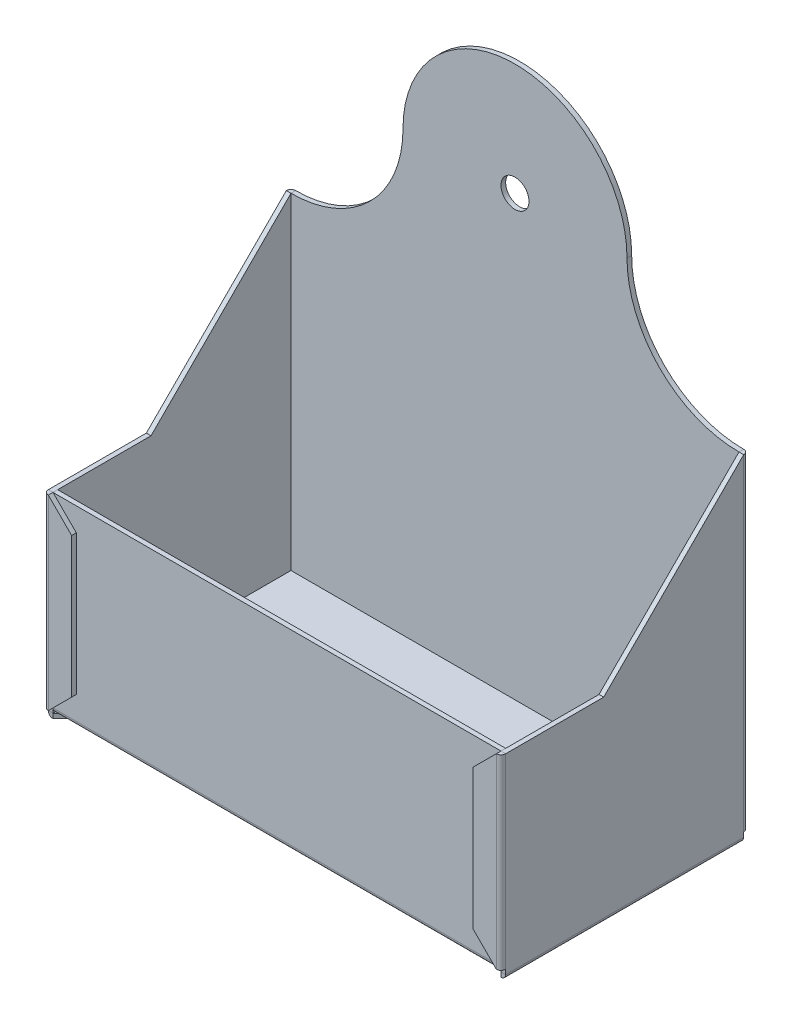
ISO-10303-21;
HEADER;
FILE_DESCRIPTION(('STEP AP214'),'2;1');
FILE_NAME('part.step','',(''),(''),'','','');
FILE_SCHEMA(('AUTOMOTIVE_DESIGN { 1 0 10303 214 1 1 1 1 }'));
ENDSEC;
DATA;
#1=APPLICATION_CONTEXT('core data for automotive mechanical design processes');
#2=APPLICATION_PROTOCOL_DEFINITION('international standard','automotive_design',2000,#1);
#3=PRODUCT_CONTEXT('',#1,'mechanical');
#4=PRODUCT('Part','Part','',(#3));
#5=PRODUCT_RELATED_PRODUCT_CATEGORY('part','',(#4));
#6=PRODUCT_DEFINITION_FORMATION('','',#4);
#7=PRODUCT_DEFINITION_CONTEXT('part definition',#1,'design');
#8=PRODUCT_DEFINITION('design','',#6,#7);
#9=PRODUCT_DEFINITION_SHAPE('','',#8);
#10=(LENGTH_UNIT() NAMED_UNIT(*) SI_UNIT(.MILLI.,.METRE.));
#11=(NAMED_UNIT(*) PLANE_ANGLE_UNIT() SI_UNIT($,.RADIAN.));
#12=(NAMED_UNIT(*) SI_UNIT($,.STERADIAN.) SOLID_ANGLE_UNIT());
#13=UNCERTAINTY_MEASURE_WITH_UNIT(LENGTH_MEASURE(1.E-05),#10,'distance_accuracy_value','');
#14=(GEOMETRIC_REPRESENTATION_CONTEXT(3) GLOBAL_UNCERTAINTY_ASSIGNED_CONTEXT((#13)) GLOBAL_UNIT_ASSIGNED_CONTEXT((#10,
#11,#12)) REPRESENTATION_CONTEXT('',''));
#15=CARTESIAN_POINT('',(0.,0.,0.));
#16=DIRECTION('',(0.,0.,1.));
#17=DIRECTION('',(1.,0.,0.));
#18=AXIS2_PLACEMENT_3D('',#15,#16,#17);
#19=CARTESIAN_POINT('',(46.001,-96.0009999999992,1.001));
#20=DIRECTION('',(0.,1.,0.));
#21=DIRECTION('',(-1.,0.,0.));
#22=AXIS2_PLACEMENT_3D('',#19,#20,#21);
#23=PLANE('',#22);
#24=DIRECTION('',(0.707106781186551,0.,-0.707106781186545));
#25=VECTOR('',#24,1.);
#26=CARTESIAN_POINT('',(53.5979340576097,-96.0009999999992,-4.59693405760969));
#27=LINE('',#26,#25);
#28=CARTESIAN_POINT('',(46.001,-96.0009999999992,2.99999999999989));
#29=VERTEX_POINT('',#28);
#30=CARTESIAN_POINT('',(47.9999999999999,-96.0009999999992,1.00100000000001));
#31=VERTEX_POINT('',#30);
#32=EDGE_CURVE('E172',#29,#31,#27,.T.);
#33=ORIENTED_EDGE('',*,*,#32,.T.);
#34=DIRECTION('',(0.,0.,1.));
#35=VECTOR('',#34,1.);
#36=CARTESIAN_POINT('',(48.,-96.0009999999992,1.00100000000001));
#37=LINE('',#36,#35);
#38=CARTESIAN_POINT('',(47.9999999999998,-96.0009999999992,51.9999842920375));
#39=VERTEX_POINT('',#38);
#40=EDGE_CURVE('E449',#39,#31,#37,.F.);
#41=ORIENTED_EDGE('',*,*,#40,.F.);
#42=DIRECTION('',(0.707106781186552,0.,0.707106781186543));
#43=VECTOR('',#42,1.);
#44=CARTESIAN_POINT('',(-31.0974262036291,-96.0009999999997,-27.0974419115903));
#45=LINE('',#44,#43);
#46=CARTESIAN_POINT('',(46.0009999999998,-96.0009999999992,50.0009842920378));
#47=VERTEX_POINT('',#46);
#48=EDGE_CURVE('E437',#47,#39,#45,.T.);
#49=ORIENTED_EDGE('',*,*,#48,.F.);
#50=DIRECTION('',(0.,0.,-1.));
#51=VECTOR('',#50,1.);
#52=CARTESIAN_POINT('',(46.001,-96.0009999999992,1.001));
#53=LINE('',#52,#51);
#54=EDGE_CURVE('E448',#29,#47,#53,.F.);
#55=ORIENTED_EDGE('',*,*,#54,.F.);
#56=EDGE_LOOP('',(#33,#41,#49,#55));
#57=FACE_BOUND('',#56,.T.);
#58=ADVANCED_FACE('F155',(#57),#23,.F.);
#59=CARTESIAN_POINT('',(46.001,-95.0009999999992,1.001));
#60=DIRECTION('',(0.,1.,0.));
#61=DIRECTION('',(-1.,0.,0.));
#62=AXIS2_PLACEMENT_3D('',#59,#60,#61);
#63=PLANE('',#62);
#64=DIRECTION('',(0.,0.,1.));
#65=VECTOR('',#64,1.);
#66=CARTESIAN_POINT('',(48.,-95.0009999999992,1.00100000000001));
#67=LINE('',#66,#65);
#68=CARTESIAN_POINT('',(47.9999999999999,-95.0009999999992,1.00100000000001));
#69=VERTEX_POINT('',#68);
#70=CARTESIAN_POINT('',(47.9999999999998,-95.0009999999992,51.9999842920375));
#71=VERTEX_POINT('',#70);
#72=EDGE_CURVE('E442',#69,#71,#67,.T.);
#73=ORIENTED_EDGE('',*,*,#72,.F.);
#74=DIRECTION('',(0.707106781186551,0.,-0.707106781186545));
#75=VECTOR('',#74,1.);
#76=CARTESIAN_POINT('',(53.5979340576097,-95.0009999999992,-4.59693405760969));
#77=LINE('',#76,#75);
#78=CARTESIAN_POINT('',(46.001,-95.0009999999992,2.99999999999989));
#79=VERTEX_POINT('',#78);
#80=EDGE_CURVE('E433',#79,#69,#77,.T.);
#81=ORIENTED_EDGE('',*,*,#80,.F.);
#82=DIRECTION('',(0.,0.,1.));
#83=VECTOR('',#82,1.);
#84=CARTESIAN_POINT('',(46.001,-95.0009999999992,1.001));
#85=LINE('',#84,#83);
#86=CARTESIAN_POINT('',(46.0009999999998,-95.0009999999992,50.0009842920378));
#87=VERTEX_POINT('',#86);
#88=EDGE_CURVE('E180',#79,#87,#85,.T.);
#89=ORIENTED_EDGE('',*,*,#88,.T.);
#90=DIRECTION('',(0.707106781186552,0.,0.707106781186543));
#91=VECTOR('',#90,1.);
#92=CARTESIAN_POINT('',(-31.0974262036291,-95.0009999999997,-27.0974419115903));
#93=LINE('',#92,#91);
#94=EDGE_CURVE('E1331',#87,#71,#93,.T.);
#95=ORIENTED_EDGE('',*,*,#94,.T.);
#96=EDGE_LOOP('',(#73,#81,#89,#95));
#97=FACE_BOUND('',#96,.T.);
#98=ADVANCED_FACE('F440',(#97),#63,.T.);
#99=CARTESIAN_POINT('',(46.001,-96.0009999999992,1.001));
#100=DIRECTION('',(-1.,0.,0.));
#101=DIRECTION('',(0.,-1.,0.));
#102=AXIS2_PLACEMENT_3D('',#99,#100,#101);
#103=PLANE('',#102);
#104=ORIENTED_EDGE('',*,*,#88,.F.);
#105=DIRECTION('',(0.,-1.,0.));
#106=VECTOR('',#105,1.);
#107=CARTESIAN_POINT('',(46.001,-95.0009999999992,2.99999999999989));
#108=LINE('',#107,#106);
#109=EDGE_CURVE('E431',#79,#29,#108,.T.);
#110=ORIENTED_EDGE('',*,*,#109,.T.);
#111=ORIENTED_EDGE('',*,*,#54,.T.);
#112=DIRECTION('',(0.,-1.,0.));
#113=VECTOR('',#112,1.);
#114=CARTESIAN_POINT('',(46.0009999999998,-95.0009999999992,50.0009842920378));
#115=LINE('',#114,#113);
#116=EDGE_CURVE('E447',#87,#47,#115,.T.);
#117=ORIENTED_EDGE('',*,*,#116,.F.);
#118=EDGE_LOOP('',(#104,#110,#111,#117));
#119=FACE_BOUND('',#118,.T.);
#120=ADVANCED_FACE('F445',(#119),#103,.T.);
#121=CARTESIAN_POINT('',(-48.001,-96.0009999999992,1.00099999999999));
#122=DIRECTION('',(0.,-1.,0.));
#123=DIRECTION('',(1.,0.,0.));
#124=AXIS2_PLACEMENT_3D('',#121,#122,#123);
#125=PLANE('',#124);
#126=DIRECTION('',(0.,0.,-1.));
#127=VECTOR('',#126,1.);
#128=CARTESIAN_POINT('',(-46.001,-96.0009999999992,1.00099999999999));
#129=LINE('',#128,#127);
#130=CARTESIAN_POINT('',(-46.0009999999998,-96.0009999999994,50.000984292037));
#131=VERTEX_POINT('',#130);
#132=CARTESIAN_POINT('',(-46.0009999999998,-96.0009999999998,3.00100100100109));
#133=VERTEX_POINT('',#132);
#134=EDGE_CURVE('E490',#131,#133,#129,.T.);
#135=ORIENTED_EDGE('',*,*,#134,.F.);
#136=DIRECTION('',(-0.707106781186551,0.,0.707106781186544));
#137=VECTOR('',#136,1.);
#138=CARTESIAN_POINT('',(31.0974262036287,-96.0009999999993,-27.0974419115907));
#139=LINE('',#138,#137);
#140=CARTESIAN_POINT('',(-47.9999999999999,-96.0009999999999,51.9999842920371));
#141=VERTEX_POINT('',#140);
#142=EDGE_CURVE('E1248',#131,#141,#139,.T.);
#143=ORIENTED_EDGE('',*,*,#142,.T.);
#144=DIRECTION('',(0.,0.,-1.));
#145=VECTOR('',#144,1.);
#146=CARTESIAN_POINT('',(-48.,-96.0009999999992,1.00099999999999));
#147=LINE('',#146,#145);
#148=CARTESIAN_POINT('',(-48.,-96.0009999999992,1.001));
#149=VERTEX_POINT('',#148);
#150=EDGE_CURVE('E496',#141,#149,#147,.T.);
#151=ORIENTED_EDGE('',*,*,#150,.T.);
#152=DIRECTION('',(-1.,0.,0.));
#153=VECTOR('',#152,1.);
#154=CARTESIAN_POINT('',(-48.001,-96.0009999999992,1.00099999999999));
#155=LINE('',#154,#153);
#156=CARTESIAN_POINT('',(-47.999001,-96.0009999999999,1.00099999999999));
#157=VERTEX_POINT('',#156);
#158=EDGE_CURVE('E487',#157,#149,#155,.T.);
#159=ORIENTED_EDGE('',*,*,#158,.F.);
#160=DIRECTION('',(-0.70675296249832,0.,-0.707460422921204));
#161=VECTOR('',#160,1.);
#162=CARTESIAN_POINT('',(-53.6214312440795,-96.0009999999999,-4.62705830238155));
#163=LINE('',#162,#161);
#164=EDGE_CURVE('E1256',#133,#157,#163,.T.);
#165=ORIENTED_EDGE('',*,*,#164,.F.);
#166=EDGE_LOOP('',(#135,#143,#151,#159,#165));
#167=FACE_BOUND('',#166,.T.);
#168=ADVANCED_FACE('F881',(#167),#125,.T.);
#169=CARTESIAN_POINT('',(-48.001,-95.0009999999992,1.001));
#170=DIRECTION('',(0.,-1.,0.));
#171=DIRECTION('',(1.,0.,0.));
#172=AXIS2_PLACEMENT_3D('',#169,#170,#171);
#173=PLANE('',#172);
#174=DIRECTION('',(-0.707106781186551,0.,0.707106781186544));
#175=VECTOR('',#174,1.);
#176=CARTESIAN_POINT('',(31.0974262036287,-95.0009999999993,-27.0974419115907));
#177=LINE('',#176,#175);
#178=CARTESIAN_POINT('',(-46.0009999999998,-95.0009999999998,50.000984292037));
#179=VERTEX_POINT('',#178);
#180=CARTESIAN_POINT('',(-47.9999999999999,-95.0009999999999,51.9999842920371));
#181=VERTEX_POINT('',#180);
#182=EDGE_CURVE('E1235',#179,#181,#177,.T.);
#183=ORIENTED_EDGE('',*,*,#182,.F.);
#184=DIRECTION('',(0.,0.,1.));
#185=VECTOR('',#184,1.);
#186=CARTESIAN_POINT('',(-46.001,-95.0009999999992,1.00099999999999));
#187=LINE('',#186,#185);
#188=CARTESIAN_POINT('',(-46.001,-95.0009999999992,3.00100100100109));
#189=VERTEX_POINT('',#188);
#190=EDGE_CURVE('E494',#179,#189,#187,.F.);
#191=ORIENTED_EDGE('',*,*,#190,.T.);
#192=DIRECTION('',(-0.70675296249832,0.,-0.707460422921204));
#193=VECTOR('',#192,1.);
#194=CARTESIAN_POINT('',(-53.6214312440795,-95.0009999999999,-4.62705830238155));
#195=LINE('',#194,#193);
#196=CARTESIAN_POINT('',(-47.999001,-95.0009999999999,1.00099999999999));
#197=VERTEX_POINT('',#196);
#198=EDGE_CURVE('E1240',#189,#197,#195,.T.);
#199=ORIENTED_EDGE('',*,*,#198,.T.);
#200=DIRECTION('',(1.,0.,0.));
#201=VECTOR('',#200,1.);
#202=CARTESIAN_POINT('',(-48.001,-95.0009999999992,1.001));
#203=LINE('',#202,#201);
#204=CARTESIAN_POINT('',(-47.9999999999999,-95.0009999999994,1.001));
#205=VERTEX_POINT('',#204);
#206=EDGE_CURVE('E492',#197,#205,#203,.F.);
#207=ORIENTED_EDGE('',*,*,#206,.T.);
#208=DIRECTION('',(0.,0.,1.));
#209=VECTOR('',#208,1.);
#210=CARTESIAN_POINT('',(-47.9999999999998,-95.0009999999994,51.9999842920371));
#211=LINE('',#210,#209);
#212=EDGE_CURVE('E502',#181,#205,#211,.F.);
#213=ORIENTED_EDGE('',*,*,#212,.F.);
#214=EDGE_LOOP('',(#183,#191,#199,#207,#213));
#215=FACE_BOUND('',#214,.T.);
#216=ADVANCED_FACE('F901',(#215),#173,.F.);
#217=CARTESIAN_POINT('',(-46.001,-96.0009999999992,1.00099999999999));
#218=DIRECTION('',(1.,0.,0.));
#219=DIRECTION('',(0.,1.,0.));
#220=AXIS2_PLACEMENT_3D('',#217,#218,#219);
#221=PLANE('',#220);
#222=ORIENTED_EDGE('',*,*,#190,.F.);
#223=DIRECTION('',(0.,-1.,0.));
#224=VECTOR('',#223,1.);
#225=CARTESIAN_POINT('',(-46.0009999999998,-95.0009999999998,50.000984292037));
#226=LINE('',#225,#224);
#227=EDGE_CURVE('E1254',#179,#131,#226,.T.);
#228=ORIENTED_EDGE('',*,*,#227,.T.);
#229=ORIENTED_EDGE('',*,*,#134,.T.);
#230=DIRECTION('',(0.,-1.,0.));
#231=VECTOR('',#230,1.);
#232=CARTESIAN_POINT('',(-46.0009999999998,-95.0009999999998,3.00100100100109));
#233=LINE('',#232,#231);
#234=EDGE_CURVE('E1263',#189,#133,#233,.T.);
#235=ORIENTED_EDGE('',*,*,#234,.F.);
#236=EDGE_LOOP('',(#222,#228,#229,#235));
#237=FACE_BOUND('',#236,.T.);
#238=ADVANCED_FACE('F905',(#237),#221,.T.);
#239=CARTESIAN_POINT('',(48.,-93.9999999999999,0.999984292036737));
#240=DIRECTION('',(-1.,0.,0.));
#241=DIRECTION('',(0.,1.,0.));
#242=AXIS2_PLACEMENT_3D('',#239,#240,#241);
#243=PLANE('',#242);
#244=DIRECTION('',(0.,0.,-1.));
#245=VECTOR('',#244,1.);
#246=CARTESIAN_POINT('',(48.,-93.9999999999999,0.999984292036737));
#247=LINE('',#246,#245);
#248=CARTESIAN_POINT('',(48.,-93.9999999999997,50.9999842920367));
#249=VERTEX_POINT('',#248);
#250=CARTESIAN_POINT('',(48.,-93.9999999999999,1.));
#251=VERTEX_POINT('',#250);
#252=EDGE_CURVE('E159',#249,#251,#247,.T.);
#253=ORIENTED_EDGE('',*,*,#252,.F.);
#254=DIRECTION('',(0.,-1.,0.));
#255=VECTOR('',#254,1.);
#256=CARTESIAN_POINT('',(48.,-94.0000000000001,50.9999842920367));
#257=LINE('',#256,#255);
#258=CARTESIAN_POINT('',(48.,-94.9999999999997,50.9999842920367));
#259=VERTEX_POINT('',#258);
#260=EDGE_CURVE('E15',#249,#259,#257,.T.);
#261=ORIENTED_EDGE('',*,*,#260,.T.);
#262=DIRECTION('',(0.,0.,-1.));
#263=VECTOR('',#262,1.);
#264=CARTESIAN_POINT('',(48.,-94.9999999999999,0.999984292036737));
#265=LINE('',#264,#263);
#266=CARTESIAN_POINT('',(48.,-94.9999999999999,1.));
#267=VERTEX_POINT('',#266);
#268=EDGE_CURVE('E1071',#259,#267,#265,.T.);
#269=ORIENTED_EDGE('',*,*,#268,.T.);
#270=DIRECTION('',(0.,-1.,0.));
#271=VECTOR('',#270,1.);
#272=CARTESIAN_POINT('',(48.,-93.9999999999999,1.));
#273=LINE('',#272,#271);
#274=EDGE_CURVE('E1057',#251,#267,#273,.T.);
#275=ORIENTED_EDGE('',*,*,#274,.F.);
#276=EDGE_LOOP('',(#253,#261,#269,#275));
#277=FACE_BOUND('',#276,.T.);
#278=ADVANCED_FACE('F157',(#277),#243,.F.);
#279=CARTESIAN_POINT('',(-48.,-93.9999999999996,90.9999842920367));
#280=DIRECTION('',(1.,0.,0.));
#281=DIRECTION('',(0.,-1.,0.));
#282=AXIS2_PLACEMENT_3D('',#279,#280,#281);
#283=PLANE('',#282);
#284=DIRECTION('',(0.,0.,1.));
#285=VECTOR('',#284,1.);
#286=CARTESIAN_POINT('',(-48.,-94.9999999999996,90.9999842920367));
#287=LINE('',#286,#285);
#288=CARTESIAN_POINT('',(-48.,-94.9999999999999,1.00000000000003));
#289=VERTEX_POINT('',#288);
#290=CARTESIAN_POINT('',(-48.,-94.9999999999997,50.9999842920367));
#291=VERTEX_POINT('',#290);
#292=EDGE_CURVE('E778',#289,#291,#287,.T.);
#293=ORIENTED_EDGE('',*,*,#292,.T.);
#294=DIRECTION('',(0.,1.,0.));
#295=VECTOR('',#294,1.);
#296=CARTESIAN_POINT('',(-48.,-93.9999999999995,50.9999842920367));
#297=LINE('',#296,#295);
#298=CARTESIAN_POINT('',(-48.,-93.9999999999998,50.9999842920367));
#299=VERTEX_POINT('',#298);
#300=EDGE_CURVE('E1066',#291,#299,#297,.T.);
#301=ORIENTED_EDGE('',*,*,#300,.T.);
#302=DIRECTION('',(0.,0.,1.));
#303=VECTOR('',#302,1.);
#304=CARTESIAN_POINT('',(-48.,-93.9999999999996,90.9999842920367));
#305=LINE('',#304,#303);
#306=CARTESIAN_POINT('',(-48.,-93.9999999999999,1.));
#307=VERTEX_POINT('',#306);
#308=EDGE_CURVE('E1073',#307,#299,#305,.T.);
#309=ORIENTED_EDGE('',*,*,#308,.F.);
#310=DIRECTION('',(0.,1.,0.));
#311=VECTOR('',#310,1.);
#312=CARTESIAN_POINT('',(-48.,-93.9999999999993,1.));
#313=LINE('',#312,#311);
#314=EDGE_CURVE('E1049',#289,#307,#313,.T.);
#315=ORIENTED_EDGE('',*,*,#314,.F.);
#316=EDGE_LOOP('',(#293,#301,#309,#315));
#317=FACE_BOUND('',#316,.T.);
#318=ADVANCED_FACE('F860',(#317),#283,.F.);
#319=CARTESIAN_POINT('',(-48.,-95.0000000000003,-93.0000157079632));
#320=DIRECTION('',(0.,1.,0.));
#321=DIRECTION('',(1.,0.,0.));
#322=AXIS2_PLACEMENT_3D('',#319,#320,#321);
#323=PLANE('',#322);
#324=ORIENTED_EDGE('',*,*,#268,.F.);
#325=DIRECTION('',(-1.,0.,0.));
#326=VECTOR('',#325,1.);
#327=CARTESIAN_POINT('',(-48.,-94.9999999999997,50.9999842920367));
#328=LINE('',#327,#326);
#329=EDGE_CURVE('E164',#259,#291,#328,.T.);
#330=ORIENTED_EDGE('',*,*,#329,.T.);
#331=ORIENTED_EDGE('',*,*,#292,.F.);
#332=DIRECTION('',(-1.,0.,0.));
#333=VECTOR('',#332,1.);
#334=CARTESIAN_POINT('',(-48.,-94.9999999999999,0.999999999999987));
#335=LINE('',#334,#333);
#336=EDGE_CURVE('E1055',#267,#289,#335,.T.);
#337=ORIENTED_EDGE('',*,*,#336,.F.);
#338=EDGE_LOOP('',(#324,#330,#331,#337));
#339=FACE_BOUND('',#338,.T.);
#340=ADVANCED_FACE('F858',(#339),#323,.F.);
#341=CARTESIAN_POINT('',(-48.,-94.0000000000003,-93.0000157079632));
#342=DIRECTION('',(0.,1.,0.));
#343=DIRECTION('',(1.,0.,0.));
#344=AXIS2_PLACEMENT_3D('',#341,#342,#343);
#345=PLANE('',#344);
#346=DIRECTION('',(-1.,0.,0.));
#347=VECTOR('',#346,1.);
#348=CARTESIAN_POINT('',(-48.,-93.9999999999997,50.9999842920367));
#349=LINE('',#348,#347);
#350=EDGE_CURVE('E1059',#249,#299,#349,.T.);
#351=ORIENTED_EDGE('',*,*,#350,.F.);
#352=ORIENTED_EDGE('',*,*,#252,.T.);
#353=DIRECTION('',(-1.,0.,0.));
#354=VECTOR('',#353,1.);
#355=CARTESIAN_POINT('',(-48.,-93.9999999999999,1.));
#356=LINE('',#355,#354);
#357=EDGE_CURVE('E664',#251,#307,#356,.T.);
#358=ORIENTED_EDGE('',*,*,#357,.T.);
#359=ORIENTED_EDGE('',*,*,#308,.T.);
#360=EDGE_LOOP('',(#351,#352,#358,#359));
#361=FACE_BOUND('',#360,.T.);
#362=ADVANCED_FACE('F855',(#361),#345,.T.);
#363=CARTESIAN_POINT('',(-48.0009999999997,-54.0000000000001,50.9994134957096));
#364=DIRECTION('',(0.,-1.,0.));
#365=DIRECTION('',(-1.,0.,0.));
#366=AXIS2_PLACEMENT_3D('',#363,#364,#365);
#367=PLANE('',#366);
#368=DIRECTION('',(0.,0.,1.));
#369=VECTOR('',#368,1.);
#370=CARTESIAN_POINT('',(-49.0009999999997,-54.0000000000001,50.9994134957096));
#371=LINE('',#370,#369);
#372=CARTESIAN_POINT('',(-49.0009999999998,-54.,30.9994134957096));
#373=VERTEX_POINT('',#372);
#374=CARTESIAN_POINT('',(-49.0009999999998,-54.0000000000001,51.9999842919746));
#375=VERTEX_POINT('',#374);
#376=EDGE_CURVE('E1197',#373,#375,#371,.T.);
#377=ORIENTED_EDGE('',*,*,#376,.T.);
#378=DIRECTION('',(-1.,0.,-6.24500451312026E-11));
#379=VECTOR('',#378,1.);
#380=CARTESIAN_POINT('',(-48.0009999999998,-54.0000000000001,51.9999842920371));
#381=LINE('',#380,#379);
#382=CARTESIAN_POINT('',(-48.0009999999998,-54.0000000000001,51.9999842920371));
#383=VERTEX_POINT('',#382);
#384=EDGE_CURVE('E622',#383,#375,#381,.T.);
#385=ORIENTED_EDGE('',*,*,#384,.F.);
#386=DIRECTION('',(0.,0.,1.));
#387=VECTOR('',#386,1.);
#388=CARTESIAN_POINT('',(-48.0009999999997,-54.0000000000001,50.9994134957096));
#389=LINE('',#388,#387);
#390=CARTESIAN_POINT('',(-48.0009999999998,-54.,30.9994134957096));
#391=VERTEX_POINT('',#390);
#392=EDGE_CURVE('E1164',#391,#383,#389,.T.);
#393=ORIENTED_EDGE('',*,*,#392,.F.);
#394=DIRECTION('',(-1.,0.,0.));
#395=VECTOR('',#394,1.);
#396=CARTESIAN_POINT('',(-48.0009999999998,-54.,30.9994134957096));
#397=LINE('',#396,#395);
#398=EDGE_CURVE('E1192',#391,#373,#397,.T.);
#399=ORIENTED_EDGE('',*,*,#398,.T.);
#400=EDGE_LOOP('',(#377,#385,#393,#399));
#401=FACE_BOUND('',#400,.T.);
#402=ADVANCED_FACE('F688',(#401),#367,.F.);
#403=CARTESIAN_POINT('',(-48.0009999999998,-54.,30.9994134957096));
#404=DIRECTION('',(0.,-0.707106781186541,-0.707106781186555));
#405=DIRECTION('',(0.,0.707106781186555,-0.707106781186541));
#406=AXIS2_PLACEMENT_3D('',#403,#404,#405);
#407=PLANE('',#406);
#408=CARTESIAN_POINT('',(-49.0009999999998,-24.0015865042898,1.00099999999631));
#409=CARTESIAN_POINT('',(-48.0009999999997,-24.0015865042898,1.001));
#410=B_SPLINE_CURVE_WITH_KNOTS('',1,(#408,#409),.UNSPECIFIED.,.F.,.F.,(2,2),(0.,1.),.UNSPECIFIED.);
#411=CARTESIAN_POINT('',(-49.0009999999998,-24.0015865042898,1.001));
#412=VERTEX_POINT('',#411);
#413=CARTESIAN_POINT('',(-48.0009999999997,-24.0015865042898,1.001));
#414=VERTEX_POINT('',#413);
#415=EDGE_CURVE('E670',#412,#414,#410,.T.);
#416=ORIENTED_EDGE('',*,*,#415,.F.);
#417=DIRECTION('',(0.,-0.707106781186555,0.707106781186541));
#418=VECTOR('',#417,1.);
#419=CARTESIAN_POINT('',(-49.0009999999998,-54.,30.9994134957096));
#420=LINE('',#419,#418);
#421=EDGE_CURVE('E1190',#412,#373,#420,.T.);
#422=ORIENTED_EDGE('',*,*,#421,.T.);
#423=ORIENTED_EDGE('',*,*,#398,.F.);
#424=DIRECTION('',(0.,-0.707106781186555,0.707106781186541));
#425=VECTOR('',#424,1.);
#426=CARTESIAN_POINT('',(-48.0009999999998,-54.,30.9994134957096));
#427=LINE('',#426,#425);
#428=EDGE_CURVE('E1167',#414,#391,#427,.T.);
#429=ORIENTED_EDGE('',*,*,#428,.F.);
#430=EDGE_LOOP('',(#416,#422,#423,#429));
#431=FACE_BOUND('',#430,.T.);
#432=ADVANCED_FACE('F677',(#431),#407,.F.);
#433=CARTESIAN_POINT('',(48.0009999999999,-53.9999999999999,30.99941349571));
#434=DIRECTION('',(0.,-1.,0.));
#435=DIRECTION('',(0.,0.,1.));
#436=AXIS2_PLACEMENT_3D('',#433,#434,#435);
#437=PLANE('',#436);
#438=DIRECTION('',(0.,0.,-1.));
#439=VECTOR('',#438,1.);
#440=CARTESIAN_POINT('',(49.0009999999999,-53.9999999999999,30.99941349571));
#441=LINE('',#440,#439);
#442=CARTESIAN_POINT('',(49.0009999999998,-53.9999999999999,51.9999842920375));
#443=VERTEX_POINT('',#442);
#444=CARTESIAN_POINT('',(49.0009999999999,-53.9999999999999,30.99941349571));
#445=VERTEX_POINT('',#444);
#446=EDGE_CURVE('E1186',#443,#445,#441,.T.);
#447=ORIENTED_EDGE('',*,*,#446,.T.);
#448=DIRECTION('',(1.,0.,0.));
#449=VECTOR('',#448,1.);
#450=CARTESIAN_POINT('',(48.0009999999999,-53.9999999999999,30.99941349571));
#451=LINE('',#450,#449);
#452=CARTESIAN_POINT('',(48.0009999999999,-53.9999999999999,30.99941349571));
#453=VERTEX_POINT('',#452);
#454=EDGE_CURVE('E1178',#453,#445,#451,.T.);
#455=ORIENTED_EDGE('',*,*,#454,.F.);
#456=DIRECTION('',(0.,0.,-1.));
#457=VECTOR('',#456,1.);
#458=CARTESIAN_POINT('',(48.0009999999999,-53.9999999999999,30.99941349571));
#459=LINE('',#458,#457);
#460=CARTESIAN_POINT('',(48.0009999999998,-53.9999999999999,51.9999842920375));
#461=VERTEX_POINT('',#460);
#462=EDGE_CURVE('E786',#461,#453,#459,.T.);
#463=ORIENTED_EDGE('',*,*,#462,.F.);
#464=DIRECTION('',(1.,0.,0.));
#465=VECTOR('',#464,1.);
#466=CARTESIAN_POINT('',(48.0009999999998,-53.9999999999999,51.9999842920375));
#467=LINE('',#466,#465);
#468=EDGE_CURVE('E571',#461,#443,#467,.T.);
#469=ORIENTED_EDGE('',*,*,#468,.T.);
#470=EDGE_LOOP('',(#447,#455,#463,#469));
#471=FACE_BOUND('',#470,.T.);
#472=ADVANCED_FACE('F687',(#471),#437,.F.);
#473=CARTESIAN_POINT('',(48.001,-24.,0.999413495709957));
#474=DIRECTION('',(0.,-0.707106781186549,-0.707106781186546));
#475=DIRECTION('',(0.,-0.707106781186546,0.707106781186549));
#476=AXIS2_PLACEMENT_3D('',#473,#474,#475);
#477=PLANE('',#476);
#478=DIRECTION('',(0.,0.707106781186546,-0.707106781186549));
#479=VECTOR('',#478,1.);
#480=CARTESIAN_POINT('',(49.001,-24.,0.999413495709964));
#481=LINE('',#480,#479);
#482=CARTESIAN_POINT('',(49.001,-24.0015865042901,1.00100000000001));
#483=VERTEX_POINT('',#482);
#484=EDGE_CURVE('E1184',#445,#483,#481,.T.);
#485=ORIENTED_EDGE('',*,*,#484,.T.);
#486=CARTESIAN_POINT('',(48.001,-24.00158650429,1.001));
#487=CARTESIAN_POINT('',(49.001,-24.00158650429,1.00099999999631));
#488=B_SPLINE_CURVE_WITH_KNOTS('',1,(#486,#487),.UNSPECIFIED.,.F.,.F.,(2,2),(0.,1.),.UNSPECIFIED.);
#489=CARTESIAN_POINT('',(48.001,-24.00158650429,1.001));
#490=VERTEX_POINT('',#489);
#491=EDGE_CURVE('E1183',#483,#490,#488,.F.);
#492=ORIENTED_EDGE('',*,*,#491,.T.);
#493=DIRECTION('',(0.,0.707106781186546,-0.707106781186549));
#494=VECTOR('',#493,1.);
#495=CARTESIAN_POINT('',(48.001,-24.,0.999413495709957));
#496=LINE('',#495,#494);
#497=EDGE_CURVE('E1158',#453,#490,#496,.T.);
#498=ORIENTED_EDGE('',*,*,#497,.F.);
#499=ORIENTED_EDGE('',*,*,#454,.T.);
#500=EDGE_LOOP('',(#485,#492,#498,#499));
#501=FACE_BOUND('',#500,.T.);
#502=ADVANCED_FACE('F692',(#501),#477,.F.);
#503=CARTESIAN_POINT('',(-49.0009999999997,0.,0.999413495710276));
#504=DIRECTION('',(1.,0.,0.));
#505=DIRECTION('',(0.,0.,-1.));
#506=AXIS2_PLACEMENT_3D('',#503,#504,#505);
#507=PLANE('',#506);
#508=DIRECTION('',(0.,1.,0.));
#509=VECTOR('',#508,1.);
#510=CARTESIAN_POINT('',(-49.0009999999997,0.,1.00100000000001));
#511=LINE('',#510,#509);
#512=CARTESIAN_POINT('',(-49.000999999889,-93.999999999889,1.001));
#513=VERTEX_POINT('',#512);
#514=EDGE_CURVE('E1153',#513,#412,#511,.T.);
#515=ORIENTED_EDGE('',*,*,#514,.F.);
#516=DIRECTION('',(1.11022302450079E-10,1.,0.));
#517=VECTOR('',#516,1.);
#518=CARTESIAN_POINT('',(-49.001,-94.9999999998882,1.001));
#519=LINE('',#518,#517);
#520=CARTESIAN_POINT('',(-49.001,-94.9999999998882,1.001));
#521=VERTEX_POINT('',#520);
#522=EDGE_CURVE('E540',#521,#513,#519,.T.);
#523=ORIENTED_EDGE('',*,*,#522,.F.);
#524=DIRECTION('',(0.,0.,-1.));
#525=VECTOR('',#524,1.);
#526=CARTESIAN_POINT('',(-49.001,-94.9999999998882,1.001));
#527=LINE('',#526,#525);
#528=CARTESIAN_POINT('',(-49.001,-94.9999999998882,51.9999842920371));
#529=VERTEX_POINT('',#528);
#530=EDGE_CURVE('E506',#521,#529,#527,.F.);
#531=ORIENTED_EDGE('',*,*,#530,.T.);
#532=DIRECTION('',(1.11022302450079E-10,1.,0.));
#533=VECTOR('',#532,1.);
#534=CARTESIAN_POINT('',(-49.001,-94.9999999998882,51.9999842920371));
#535=LINE('',#534,#533);
#536=CARTESIAN_POINT('',(-49.0009999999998,-94.0000000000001,51.9999842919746));
#537=VERTEX_POINT('',#536);
#538=EDGE_CURVE('E537',#529,#537,#535,.T.);
#539=ORIENTED_EDGE('',*,*,#538,.T.);
#540=DIRECTION('',(0.,-1.,0.));
#541=VECTOR('',#540,1.);
#542=CARTESIAN_POINT('',(-49.0009999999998,-94.0000000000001,51.9999842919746));
#543=LINE('',#542,#541);
#544=EDGE_CURVE('E605',#537,#375,#543,.F.);
#545=ORIENTED_EDGE('',*,*,#544,.T.);
#546=ORIENTED_EDGE('',*,*,#376,.F.);
#547=ORIENTED_EDGE('',*,*,#421,.F.);
#548=EDGE_LOOP('',(#515,#523,#531,#539,#545,#546,#547));
#549=FACE_BOUND('',#548,.T.);
#550=ADVANCED_FACE('F697',(#549),#507,.F.);
#551=CARTESIAN_POINT('',(49.0010000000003,0.,-95.0005865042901));
#552=DIRECTION('',(-1.,0.,0.));
#553=DIRECTION('',(0.,0.,1.));
#554=AXIS2_PLACEMENT_3D('',#551,#552,#553);
#555=PLANE('',#554);
#556=DIRECTION('',(0.,1.,0.));
#557=VECTOR('',#556,1.);
#558=CARTESIAN_POINT('',(49.0009999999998,-53.9999999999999,51.9999842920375));
#559=LINE('',#558,#557);
#560=CARTESIAN_POINT('',(49.0009999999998,-93.9999999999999,51.9999842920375));
#561=VERTEX_POINT('',#560);
#562=EDGE_CURVE('E564',#443,#561,#559,.F.);
#563=ORIENTED_EDGE('',*,*,#562,.T.);
#564=DIRECTION('',(-1.38777878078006E-11,1.,0.));
#565=VECTOR('',#564,1.);
#566=CARTESIAN_POINT('',(49.0009999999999,-94.9999999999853,51.9999842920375));
#567=LINE('',#566,#565);
#568=CARTESIAN_POINT('',(49.0009999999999,-94.9999999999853,51.9999842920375));
#569=VERTEX_POINT('',#568);
#570=EDGE_CURVE('E531',#569,#561,#567,.T.);
#571=ORIENTED_EDGE('',*,*,#570,.F.);
#572=DIRECTION('',(0.,0.,1.));
#573=VECTOR('',#572,1.);
#574=CARTESIAN_POINT('',(49.0009999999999,-94.9999999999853,51.9999842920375));
#575=LINE('',#574,#573);
#576=CARTESIAN_POINT('',(49.0009999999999,-94.9999999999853,1.00100000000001));
#577=VERTEX_POINT('',#576);
#578=EDGE_CURVE('E464',#569,#577,#575,.F.);
#579=ORIENTED_EDGE('',*,*,#578,.T.);
#580=DIRECTION('',(-1.38777878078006E-11,1.,0.));
#581=VECTOR('',#580,1.);
#582=CARTESIAN_POINT('',(49.0009999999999,-94.9999999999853,1.00100000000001));
#583=LINE('',#582,#581);
#584=CARTESIAN_POINT('',(49.000999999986,-93.999999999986,1.00100000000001));
#585=VERTEX_POINT('',#584);
#586=EDGE_CURVE('E529',#577,#585,#583,.T.);
#587=ORIENTED_EDGE('',*,*,#586,.T.);
#588=DIRECTION('',(0.,1.,0.));
#589=VECTOR('',#588,1.);
#590=CARTESIAN_POINT('',(49.001,0.,1.00100000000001));
#591=LINE('',#590,#589);
#592=EDGE_CURVE('E1173',#585,#483,#591,.T.);
#593=ORIENTED_EDGE('',*,*,#592,.T.);
#594=ORIENTED_EDGE('',*,*,#484,.F.);
#595=ORIENTED_EDGE('',*,*,#446,.F.);
#596=EDGE_LOOP('',(#563,#571,#579,#587,#593,#594,#595));
#597=FACE_BOUND('',#596,.T.);
#598=ADVANCED_FACE('F1310',(#597),#555,.F.);
#599=CARTESIAN_POINT('',(-48.0009999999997,0.,0.999413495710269));
#600=DIRECTION('',(1.,0.,0.));
#601=DIRECTION('',(0.,0.,-1.));
#602=AXIS2_PLACEMENT_3D('',#599,#600,#601);
#603=PLANE('',#602);
#604=DIRECTION('',(0.,-1.,0.));
#605=VECTOR('',#604,1.);
#606=CARTESIAN_POINT('',(-48.0009999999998,-94.0000000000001,51.9999842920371));
#607=LINE('',#606,#605);
#608=CARTESIAN_POINT('',(-48.0009999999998,-94.0000000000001,51.9999842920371));
#609=VERTEX_POINT('',#608);
#610=EDGE_CURVE('E618',#609,#383,#607,.F.);
#611=ORIENTED_EDGE('',*,*,#610,.F.);
#612=DIRECTION('',(1.11022302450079E-10,1.,0.));
#613=VECTOR('',#612,1.);
#614=CARTESIAN_POINT('',(-48.001,-94.9999999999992,51.9999842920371));
#615=LINE('',#614,#613);
#616=CARTESIAN_POINT('',(-48.001,-94.9999999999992,51.9999842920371));
#617=VERTEX_POINT('',#616);
#618=EDGE_CURVE('E535',#617,#609,#615,.T.);
#619=ORIENTED_EDGE('',*,*,#618,.F.);
#620=DIRECTION('',(0.,0.,-1.));
#621=VECTOR('',#620,1.);
#622=CARTESIAN_POINT('',(-48.001,-94.9999999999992,1.001));
#623=LINE('',#622,#621);
#624=CARTESIAN_POINT('',(-48.001,-94.9999999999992,1.001));
#625=VERTEX_POINT('',#624);
#626=EDGE_CURVE('E519',#625,#617,#623,.F.);
#627=ORIENTED_EDGE('',*,*,#626,.F.);
#628=DIRECTION('',(1.11022302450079E-10,1.,0.));
#629=VECTOR('',#628,1.);
#630=CARTESIAN_POINT('',(-48.001,-94.9999999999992,1.001));
#631=LINE('',#630,#629);
#632=CARTESIAN_POINT('',(-48.001,-93.9999999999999,1.001));
#633=VERTEX_POINT('',#632);
#634=EDGE_CURVE('E543',#625,#633,#631,.T.);
#635=ORIENTED_EDGE('',*,*,#634,.T.);
#636=DIRECTION('',(0.,1.,0.));
#637=VECTOR('',#636,1.);
#638=CARTESIAN_POINT('',(-48.0009999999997,0.,1.001));
#639=LINE('',#638,#637);
#640=EDGE_CURVE('E1169',#633,#414,#639,.T.);
#641=ORIENTED_EDGE('',*,*,#640,.T.);
#642=ORIENTED_EDGE('',*,*,#428,.T.);
#643=ORIENTED_EDGE('',*,*,#392,.T.);
#644=EDGE_LOOP('',(#611,#619,#627,#635,#641,#642,#643));
#645=FACE_BOUND('',#644,.T.);
#646=ADVANCED_FACE('F731',(#645),#603,.T.);
#647=CARTESIAN_POINT('',(-48.0000000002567,-24.,0.));
#648=CARTESIAN_POINT('',(-48.1310542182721,-24.0001275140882,3.3646735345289E-11));
#649=CARTESIAN_POINT('',(-48.2620096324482,-24.000256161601,0.0260533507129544));
#650=CARTESIAN_POINT('',(-48.5041225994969,-24.0005158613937,0.126339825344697));
#651=CARTESIAN_POINT('',(-48.6151612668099,-24.0006468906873,0.200533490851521));
#652=CARTESIAN_POINT('',(-48.800466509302,-24.000911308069,0.385838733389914));
#653=CARTESIAN_POINT('',(-48.8746601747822,-24.001044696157,0.496877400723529));
#654=CARTESIAN_POINT('',(-48.9749466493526,-24.0013138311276,0.738990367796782));
#655=CARTESIAN_POINT('',(-49.0009999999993,-24.0014495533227,0.869945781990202));
#656=CARTESIAN_POINT('',(-49.0009999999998,-24.0015865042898,1.00099999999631));
#657=CARTESIAN_POINT('',(-48.,-24.,1.));
#658=CARTESIAN_POINT('',(-48.0001309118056,-24.0001275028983,1.00000000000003));
#659=CARTESIAN_POINT('',(-48.0002617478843,-24.000256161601,1.00002602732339));
#660=CARTESIAN_POINT('',(-48.0005036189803,-24.0005158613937,1.00012621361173));
#661=CARTESIAN_POINT('',(-48.0006145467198,-24.0006468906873,1.00020033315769));
#662=CARTESIAN_POINT('',(-48.0007996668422,-24.000911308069,1.00038545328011));
#663=CARTESIAN_POINT('',(-48.0008737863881,-24.001044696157,1.0004963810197));
#664=CARTESIAN_POINT('',(-48.0009739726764,-24.0013138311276,1.00073825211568));
#665=CARTESIAN_POINT('',(-48.0009999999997,-24.0014495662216,1.00086908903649));
#666=CARTESIAN_POINT('',(-48.0009999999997,-24.0015865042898,1.001));
#667=B_SPLINE_SURFACE_WITH_KNOTS('',1,3,((#647,#648,#649,#650,#651,#652,#653,#654,#655,#656),
(#657,#658,#659,#660,#661,#662,#663,#664,#665,#666)),.UNSPECIFIED.,.F.,.F.,.F.,(2,2),(4,2,2,2,
4),(0.,1.),(0.,0.25,0.5,0.75,1.),.UNSPECIFIED.);
#668=CARTESIAN_POINT('',(-48.0000000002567,-24.,0.));
#669=CARTESIAN_POINT('',(-48.1310542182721,-24.0001275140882,3.3646735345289E-11));
#670=CARTESIAN_POINT('',(-48.2620096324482,-24.000256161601,0.0260533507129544));
#671=CARTESIAN_POINT('',(-48.5041225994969,-24.0005158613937,0.126339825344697));
#672=CARTESIAN_POINT('',(-48.6151612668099,-24.0006468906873,0.200533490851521));
#673=CARTESIAN_POINT('',(-48.800466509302,-24.000911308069,0.385838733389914));
#674=CARTESIAN_POINT('',(-48.8746601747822,-24.001044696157,0.496877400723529));
#675=CARTESIAN_POINT('',(-48.9749466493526,-24.0013138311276,0.738990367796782));
#676=CARTESIAN_POINT('',(-49.0009999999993,-24.0014495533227,0.869945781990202));
#677=CARTESIAN_POINT('',(-49.0009999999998,-24.0015865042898,1.00099999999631));
#678=B_SPLINE_CURVE_WITH_KNOTS('',3,(#668,#669,#670,#671,#672,#673,#674,#675,#676,#677),
.UNSPECIFIED.,.F.,.F.,(4,2,2,2,4),(0.,0.25,0.5,0.75,1.),.UNSPECIFIED.);
#679=CARTESIAN_POINT('',(-48.0000000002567,-24.,0.));
#680=VERTEX_POINT('',#679);
#681=EDGE_CURVE('E712',#680,#412,#678,.T.);
#682=CARTESIAN_POINT('',(-48.0009999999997,-24.0015865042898,1.001));
#683=CARTESIAN_POINT('',(-48.0009999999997,-24.0014495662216,1.00086908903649));
#684=CARTESIAN_POINT('',(-48.0009739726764,-24.0013138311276,1.00073825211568));
#685=CARTESIAN_POINT('',(-48.0008737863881,-24.001044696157,1.0004963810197));
#686=CARTESIAN_POINT('',(-48.0007996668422,-24.000911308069,1.00038545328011));
#687=CARTESIAN_POINT('',(-48.0006145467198,-24.0006468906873,1.00020033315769));
#688=CARTESIAN_POINT('',(-48.0005036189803,-24.0005158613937,1.00012621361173));
#689=CARTESIAN_POINT('',(-48.0002617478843,-24.000256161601,1.00002602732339));
#690=CARTESIAN_POINT('',(-48.0001309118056,-24.0001275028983,1.00000000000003));
#691=CARTESIAN_POINT('',(-48.,-24.,1.));
#692=B_SPLINE_CURVE_WITH_KNOTS('',3,(#682,#683,#684,#685,#686,#687,#688,#689,#690,#691),
.UNSPECIFIED.,.F.,.F.,(4,2,2,2,4),(0.,0.25,0.5,0.75,1.),.UNSPECIFIED.);
#693=CARTESIAN_POINT('',(-48.,-24.,1.));
#694=VERTEX_POINT('',#693);
#695=EDGE_CURVE('E756',#694,#414,#692,.F.);
#696=CARTESIAN_POINT('',(-48.,-24.,1.));
#697=CARTESIAN_POINT('',(-48.0000000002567,-24.,0.));
#698=B_SPLINE_CURVE_WITH_KNOTS('',1,(#696,#697),.UNSPECIFIED.,.F.,.F.,(2,2),(0.,1.),.UNSPECIFIED.);
#699=EDGE_CURVE('E759',#694,#680,#698,.T.);
#700=ORIENTED_EDGE('',*,*,#681,.T.);
#701=ORIENTED_EDGE('',*,*,#415,.T.);
#702=ORIENTED_EDGE('',*,*,#695,.F.);
#703=ORIENTED_EDGE('',*,*,#699,.T.);
#704=EDGE_LOOP('',(#700,#701,#702,#703));
#705=FACE_BOUND('',#704,.T.);
#706=ADVANCED_FACE('F718',(#705),#667,.F.);
#707=CARTESIAN_POINT('',(48.0010000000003,0.,-95.0005865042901));
#708=DIRECTION('',(-1.,0.,0.));
#709=DIRECTION('',(0.,0.,1.));
#710=AXIS2_PLACEMENT_3D('',#707,#708,#709);
#711=PLANE('',#710);
#712=DIRECTION('',(0.,1.,0.));
#713=VECTOR('',#712,1.);
#714=CARTESIAN_POINT('',(48.001,0.,1.001));
#715=LINE('',#714,#713);
#716=CARTESIAN_POINT('',(48.000999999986,-93.9999999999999,1.00100000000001));
#717=VERTEX_POINT('',#716);
#718=EDGE_CURVE('E1098',#717,#490,#715,.T.);
#719=ORIENTED_EDGE('',*,*,#718,.F.);
#720=DIRECTION('',(-1.38777878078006E-11,1.,0.));
#721=VECTOR('',#720,1.);
#722=CARTESIAN_POINT('',(48.0009999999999,-94.9999999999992,1.00100000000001));
#723=LINE('',#722,#721);
#724=CARTESIAN_POINT('',(48.0009999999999,-94.9999999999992,1.00100000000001));
#725=VERTEX_POINT('',#724);
#726=EDGE_CURVE('E526',#725,#717,#723,.T.);
#727=ORIENTED_EDGE('',*,*,#726,.F.);
#728=DIRECTION('',(0.,0.,1.));
#729=VECTOR('',#728,1.);
#730=CARTESIAN_POINT('',(48.0009999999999,-94.9999999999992,51.9999842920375));
#731=LINE('',#730,#729);
#732=CARTESIAN_POINT('',(48.0009999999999,-94.9999999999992,51.9999842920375));
#733=VERTEX_POINT('',#732);
#734=EDGE_CURVE('E477',#733,#725,#731,.F.);
#735=ORIENTED_EDGE('',*,*,#734,.F.);
#736=DIRECTION('',(-1.38777878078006E-11,1.,0.));
#737=VECTOR('',#736,1.);
#738=CARTESIAN_POINT('',(48.0009999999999,-94.9999999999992,51.9999842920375));
#739=LINE('',#738,#737);
#740=CARTESIAN_POINT('',(48.000999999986,-93.9999999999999,51.9999842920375));
#741=VERTEX_POINT('',#740);
#742=EDGE_CURVE('E533',#733,#741,#739,.T.);
#743=ORIENTED_EDGE('',*,*,#742,.T.);
#744=DIRECTION('',(0.,1.,0.));
#745=VECTOR('',#744,1.);
#746=CARTESIAN_POINT('',(48.0009999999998,-53.9999999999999,51.9999842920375));
#747=LINE('',#746,#745);
#748=EDGE_CURVE('E577',#461,#741,#747,.F.);
#749=ORIENTED_EDGE('',*,*,#748,.F.);
#750=ORIENTED_EDGE('',*,*,#462,.T.);
#751=ORIENTED_EDGE('',*,*,#497,.T.);
#752=EDGE_LOOP('',(#719,#727,#735,#743,#749,#750,#751));
#753=FACE_BOUND('',#752,.T.);
#754=ADVANCED_FACE('F730',(#753),#711,.T.);
#755=CARTESIAN_POINT('',(49.001,-24.00158650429,1.00099999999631));
#756=CARTESIAN_POINT('',(49.0009999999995,-24.0014589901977,0.869945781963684));
#757=CARTESIAN_POINT('',(48.9749466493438,-24.0013303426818,0.738990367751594));
#758=CARTESIAN_POINT('',(48.8746601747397,-24.0010706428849,0.496877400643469));
#759=CARTESIAN_POINT('',(48.8004665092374,-24.0009396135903,0.38583873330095));
#760=CARTESIAN_POINT('',(48.6151612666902,-24.0006751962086,0.200533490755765));
#761=CARTESIAN_POINT('',(48.504122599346,-24.0005418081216,0.126339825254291));
#762=CARTESIAN_POINT('',(48.2620096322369,-24.0002726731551,0.0260533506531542));
#763=CARTESIAN_POINT('',(48.1310542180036,-24.000136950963,-9.09825434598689E-13));
#764=CARTESIAN_POINT('',(47.9999999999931,-24.,0.));
#765=CARTESIAN_POINT('',(48.001,-24.00158650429,1.001));
#766=CARTESIAN_POINT('',(48.001,-24.0014590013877,1.00086908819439));
#767=CARTESIAN_POINT('',(48.0009739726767,-24.0013303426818,1.00073825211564));
#768=CARTESIAN_POINT('',(48.0008737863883,-24.0010706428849,1.00049638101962));
#769=CARTESIAN_POINT('',(48.0007996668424,-24.0009396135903,1.00038545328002));
#770=CARTESIAN_POINT('',(48.00061454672,-24.0006751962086,1.0002003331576));
#771=CARTESIAN_POINT('',(48.0005036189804,-24.0005418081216,1.00012621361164));
#772=CARTESIAN_POINT('',(48.0002617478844,-24.0002726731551,1.00002602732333));
#773=CARTESIAN_POINT('',(48.0001309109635,-24.0001369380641,0.999999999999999));
#774=CARTESIAN_POINT('',(48.,-24.,1.));
#775=B_SPLINE_SURFACE_WITH_KNOTS('',1,3,((#755,#756,#757,#758,#759,#760,#761,#762,#763,#764),
(#765,#766,#767,#768,#769,#770,#771,#772,#773,#774)),.UNSPECIFIED.,.F.,.F.,.F.,(2,2),(4,2,2,2,
4),(0.,1.),(0.,0.25,0.5,0.75,1.),.UNSPECIFIED.);
#776=CARTESIAN_POINT('',(49.001,-24.00158650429,1.00099999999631));
#777=CARTESIAN_POINT('',(49.0009999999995,-24.0014589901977,0.869945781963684));
#778=CARTESIAN_POINT('',(48.9749466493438,-24.0013303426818,0.738990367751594));
#779=CARTESIAN_POINT('',(48.8746601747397,-24.0010706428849,0.496877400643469));
#780=CARTESIAN_POINT('',(48.8004665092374,-24.0009396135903,0.38583873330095));
#781=CARTESIAN_POINT('',(48.6151612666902,-24.0006751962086,0.200533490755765));
#782=CARTESIAN_POINT('',(48.504122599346,-24.0005418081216,0.126339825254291));
#783=CARTESIAN_POINT('',(48.2620096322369,-24.0002726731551,0.0260533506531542));
#784=CARTESIAN_POINT('',(48.1310542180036,-24.000136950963,-9.09825434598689E-13));
#785=CARTESIAN_POINT('',(47.9999999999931,-24.,0.));
#786=B_SPLINE_CURVE_WITH_KNOTS('',3,(#776,#777,#778,#779,#780,#781,#782,#783,#784,#785),
.UNSPECIFIED.,.F.,.F.,(4,2,2,2,4),(0.,0.25,0.5,0.75,1.),.UNSPECIFIED.);
#787=CARTESIAN_POINT('',(48.,-24.,0.));
#788=VERTEX_POINT('',#787);
#789=EDGE_CURVE('E1155',#483,#788,#786,.T.);
#790=CARTESIAN_POINT('',(47.9999999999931,-24.,0.));
#791=CARTESIAN_POINT('',(48.,-24.,1.));
#792=B_SPLINE_CURVE_WITH_KNOTS('',1,(#790,#791),.UNSPECIFIED.,.F.,.F.,(2,2),(0.,1.),.UNSPECIFIED.);
#793=CARTESIAN_POINT('',(48.,-24.,1.));
#794=VERTEX_POINT('',#793);
#795=EDGE_CURVE('E1089',#794,#788,#792,.F.);
#796=CARTESIAN_POINT('',(48.,-24.,1.));
#797=CARTESIAN_POINT('',(48.0001309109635,-24.0001369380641,0.999999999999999));
#798=CARTESIAN_POINT('',(48.0002617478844,-24.0002726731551,1.00002602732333));
#799=CARTESIAN_POINT('',(48.0005036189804,-24.0005418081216,1.00012621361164));
#800=CARTESIAN_POINT('',(48.00061454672,-24.0006751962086,1.0002003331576));
#801=CARTESIAN_POINT('',(48.0007996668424,-24.0009396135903,1.00038545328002));
#802=CARTESIAN_POINT('',(48.0008737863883,-24.0010706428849,1.00049638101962));
#803=CARTESIAN_POINT('',(48.0009739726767,-24.0013303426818,1.00073825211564));
#804=CARTESIAN_POINT('',(48.001,-24.0014590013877,1.00086908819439));
#805=CARTESIAN_POINT('',(48.001,-24.00158650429,1.001));
#806=B_SPLINE_CURVE_WITH_KNOTS('',3,(#796,#797,#798,#799,#800,#801,#802,#803,#804,#805),
.UNSPECIFIED.,.F.,.F.,(4,2,2,2,4),(0.,0.25,0.5,0.75,1.),.UNSPECIFIED.);
#807=EDGE_CURVE('E838',#490,#794,#806,.F.);
#808=ORIENTED_EDGE('',*,*,#491,.F.);
#809=ORIENTED_EDGE('',*,*,#789,.T.);
#810=ORIENTED_EDGE('',*,*,#795,.F.);
#811=ORIENTED_EDGE('',*,*,#807,.F.);
#812=EDGE_LOOP('',(#808,#809,#810,#811));
#813=FACE_BOUND('',#812,.T.);
#814=ADVANCED_FACE('F1586',(#813),#775,.F.);
#815=CARTESIAN_POINT('',(-47.9999999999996,11.0071425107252,1.001));
#816=DIRECTION('',(0.,-1.,0.));
#817=DIRECTION('',(1.,0.,0.));
#818=AXIS2_PLACEMENT_3D('',#815,#816,#817);
#819=CYLINDRICAL_SURFACE('',#818,1.001);
#820=DIRECTION('',(0.,1.,0.));
#821=VECTOR('',#820,1.);
#822=CARTESIAN_POINT('',(-47.9999999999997,0.,0.));
#823=LINE('',#822,#821);
#824=CARTESIAN_POINT('',(-48.,-93.9999999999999,0.));
#825=VERTEX_POINT('',#824);
#826=EDGE_CURVE('E1114',#825,#680,#823,.T.);
#827=ORIENTED_EDGE('',*,*,#826,.F.);
#828=CARTESIAN_POINT('',(-48.,-93.9999999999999,1.001));
#829=DIRECTION('',(0.,-1.,0.));
#830=DIRECTION('',(1.,0.,0.));
#831=AXIS2_PLACEMENT_3D('',#828,#829,#830);
#832=CIRCLE('',#831,1.001);
#833=EDGE_CURVE('E1138',#513,#825,#832,.T.);
#834=ORIENTED_EDGE('',*,*,#833,.F.);
#835=ORIENTED_EDGE('',*,*,#514,.T.);
#836=ORIENTED_EDGE('',*,*,#681,.F.);
#837=EDGE_LOOP('',(#827,#834,#835,#836));
#838=FACE_BOUND('',#837,.T.);
#839=ADVANCED_FACE('F1581',(#838),#819,.T.);
#840=CARTESIAN_POINT('',(48.,-129.007142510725,1.001));
#841=DIRECTION('',(0.,1.,0.));
#842=DIRECTION('',(-1.,0.,0.));
#843=AXIS2_PLACEMENT_3D('',#840,#841,#842);
#844=CYLINDRICAL_SURFACE('',#843,1.001);
#845=ORIENTED_EDGE('',*,*,#789,.F.);
#846=ORIENTED_EDGE('',*,*,#592,.F.);
#847=CARTESIAN_POINT('',(48.,-93.9999999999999,1.001));
#848=DIRECTION('',(0.,1.,0.));
#849=DIRECTION('',(-1.,0.,0.));
#850=AXIS2_PLACEMENT_3D('',#847,#848,#849);
#851=CIRCLE('',#850,1.001);
#852=CARTESIAN_POINT('',(47.9999999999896,-93.9999999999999,0.));
#853=VERTEX_POINT('',#852);
#854=EDGE_CURVE('E1088',#853,#585,#851,.F.);
#855=ORIENTED_EDGE('',*,*,#854,.F.);
#856=DIRECTION('',(0.,1.,0.));
#857=VECTOR('',#856,1.);
#858=CARTESIAN_POINT('',(48.,0.,0.));
#859=LINE('',#858,#857);
#860=EDGE_CURVE('E1148',#853,#788,#859,.T.);
#861=ORIENTED_EDGE('',*,*,#860,.T.);
#862=EDGE_LOOP('',(#845,#846,#855,#861));
#863=FACE_BOUND('',#862,.T.);
#864=ADVANCED_FACE('F1570',(#863),#844,.T.);
#865=CARTESIAN_POINT('',(0.,0.,1.));
#866=DIRECTION('',(0.,0.,-1.));
#867=DIRECTION('',(-1.,0.,0.));
#868=AXIS2_PLACEMENT_3D('',#865,#866,#867);
#869=CYLINDRICAL_SURFACE('',#868,3.);
#870=CARTESIAN_POINT('',(0.,0.,1.));
#871=DIRECTION('',(0.,0.,1.));
#872=DIRECTION('',(1.,0.,0.));
#873=AXIS2_PLACEMENT_3D('',#870,#871,#872);
#874=CIRCLE('',#873,3.);
#875=CARTESIAN_POINT('',(3.,0.,1.));
#876=VERTEX_POINT('',#875);
#877=EDGE_CURVE('E1145',#876,#876,#874,.T.);
#878=ORIENTED_EDGE('',*,*,#877,.T.);
#879=EDGE_LOOP('',(#878));
#880=FACE_BOUND('',#879,.T.);
#881=CARTESIAN_POINT('',(0.,0.,0.));
#882=DIRECTION('',(0.,0.,1.));
#883=DIRECTION('',(1.,0.,0.));
#884=AXIS2_PLACEMENT_3D('',#881,#882,#883);
#885=CIRCLE('',#884,3.);
#886=CARTESIAN_POINT('',(3.,0.,0.));
#887=VERTEX_POINT('',#886);
#888=EDGE_CURVE('E1123',#887,#887,#885,.T.);
#889=ORIENTED_EDGE('',*,*,#888,.F.);
#890=EDGE_LOOP('',(#889));
#891=FACE_BOUND('',#890,.T.);
#892=ADVANCED_FACE('F1564',(#880,#891),#869,.F.);
#893=CARTESIAN_POINT('',(-48.,-93.9999999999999,1.001));
#894=DIRECTION('',(0.,1.,0.));
#895=DIRECTION('',(0.,0.,1.));
#896=AXIS2_PLACEMENT_3D('',#893,#894,#895);
#897=PLANE('',#896);
#898=DIRECTION('',(-1.,0.,0.));
#899=VECTOR('',#898,1.);
#900=CARTESIAN_POINT('',(-48.001,-93.9999999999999,1.001));
#901=LINE('',#900,#899);
#902=EDGE_CURVE('E1142',#633,#513,#901,.T.);
#903=ORIENTED_EDGE('',*,*,#902,.T.);
#904=ORIENTED_EDGE('',*,*,#833,.T.);
#905=DIRECTION('',(0.,0.,-1.));
#906=VECTOR('',#905,1.);
#907=CARTESIAN_POINT('',(-48.,-93.9999999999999,1.));
#908=LINE('',#907,#906);
#909=EDGE_CURVE('E1051',#307,#825,#908,.T.);
#910=ORIENTED_EDGE('',*,*,#909,.F.);
#911=CARTESIAN_POINT('',(-48.,-93.9999999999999,1.001));
#912=DIRECTION('',(0.,-1.,0.));
#913=DIRECTION('',(0.,0.,-1.));
#914=AXIS2_PLACEMENT_3D('',#911,#912,#913);
#915=CIRCLE('',#914,0.00100000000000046);
#916=EDGE_CURVE('E763',#633,#307,#915,.T.);
#917=ORIENTED_EDGE('',*,*,#916,.F.);
#918=EDGE_LOOP('',(#903,#904,#910,#917));
#919=FACE_BOUND('',#918,.T.);
#920=ADVANCED_FACE('F1569',(#919),#897,.F.);
#921=CARTESIAN_POINT('',(-47.9999999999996,11.0071425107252,1.001));
#922=DIRECTION('',(0.,-1.,0.));
#923=DIRECTION('',(1.,0.,0.));
#924=AXIS2_PLACEMENT_3D('',#921,#922,#923);
#925=CYLINDRICAL_SURFACE('',#924,0.001);
#926=DIRECTION('',(0.,1.,0.));
#927=VECTOR('',#926,1.);
#928=CARTESIAN_POINT('',(-47.9999999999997,0.,1.));
#929=LINE('',#928,#927);
#930=EDGE_CURVE('E764',#307,#694,#929,.T.);
#931=ORIENTED_EDGE('',*,*,#930,.T.);
#932=ORIENTED_EDGE('',*,*,#695,.T.);
#933=ORIENTED_EDGE('',*,*,#640,.F.);
#934=ORIENTED_EDGE('',*,*,#916,.T.);
#935=EDGE_LOOP('',(#931,#932,#933,#934));
#936=FACE_BOUND('',#935,.T.);
#937=ADVANCED_FACE('F807',(#936),#925,.F.);
#938=CARTESIAN_POINT('',(-48.,0.,1.));
#939=DIRECTION('',(0.,0.,-1.));
#940=DIRECTION('',(-1.,0.,0.));
#941=AXIS2_PLACEMENT_3D('',#938,#939,#940);
#942=CYLINDRICAL_SURFACE('',#941,24.);
#943=CARTESIAN_POINT('',(-48.,0.,0.));
#944=DIRECTION('',(0.,0.,-1.));
#945=DIRECTION('',(1.,0.,0.));
#946=AXIS2_PLACEMENT_3D('',#943,#944,#945);
#947=CIRCLE('',#946,24.);
#948=CARTESIAN_POINT('',(-24.,0.,0.));
#949=VERTEX_POINT('',#948);
#950=EDGE_CURVE('E784',#949,#680,#947,.T.);
#951=ORIENTED_EDGE('',*,*,#950,.T.);
#952=ORIENTED_EDGE('',*,*,#699,.F.);
#953=CARTESIAN_POINT('',(-48.,0.,1.));
#954=DIRECTION('',(0.,0.,-1.));
#955=DIRECTION('',(1.,0.,0.));
#956=AXIS2_PLACEMENT_3D('',#953,#954,#955);
#957=CIRCLE('',#956,24.);
#958=CARTESIAN_POINT('',(-24.,0.,1.));
#959=VERTEX_POINT('',#958);
#960=EDGE_CURVE('E768',#959,#694,#957,.T.);
#961=ORIENTED_EDGE('',*,*,#960,.F.);
#962=DIRECTION('',(0.,0.,-1.));
#963=VECTOR('',#962,1.);
#964=CARTESIAN_POINT('',(-24.,0.,1.));
#965=LINE('',#964,#963);
#966=EDGE_CURVE('E1131',#959,#949,#965,.T.);
#967=ORIENTED_EDGE('',*,*,#966,.T.);
#968=EDGE_LOOP('',(#951,#952,#961,#967));
#969=FACE_BOUND('',#968,.T.);
#970=ADVANCED_FACE('F782',(#969),#942,.F.);
#971=CARTESIAN_POINT('',(0.,0.,1.));
#972=DIRECTION('',(0.,0.,-1.));
#973=DIRECTION('',(-1.,0.,0.));
#974=AXIS2_PLACEMENT_3D('',#971,#972,#973);
#975=CYLINDRICAL_SURFACE('',#974,24.);
#976=CARTESIAN_POINT('',(0.,0.,0.));
#977=DIRECTION('',(0.,0.,1.));
#978=DIRECTION('',(1.,0.,0.));
#979=AXIS2_PLACEMENT_3D('',#976,#977,#978);
#980=CIRCLE('',#979,24.);
#981=CARTESIAN_POINT('',(24.,0.,0.));
#982=VERTEX_POINT('',#981);
#983=EDGE_CURVE('E1129',#982,#949,#980,.T.);
#984=ORIENTED_EDGE('',*,*,#983,.T.);
#985=ORIENTED_EDGE('',*,*,#966,.F.);
#986=CARTESIAN_POINT('',(0.,0.,1.));
#987=DIRECTION('',(0.,0.,1.));
#988=DIRECTION('',(1.,0.,0.));
#989=AXIS2_PLACEMENT_3D('',#986,#987,#988);
#990=CIRCLE('',#989,24.);
#991=CARTESIAN_POINT('',(24.,0.,1.));
#992=VERTEX_POINT('',#991);
#993=EDGE_CURVE('E774',#992,#959,#990,.T.);
#994=ORIENTED_EDGE('',*,*,#993,.F.);
#995=DIRECTION('',(0.,0.,-1.));
#996=VECTOR('',#995,1.);
#997=CARTESIAN_POINT('',(24.,0.,1.));
#998=LINE('',#997,#996);
#999=EDGE_CURVE('E1126',#992,#982,#998,.T.);
#1000=ORIENTED_EDGE('',*,*,#999,.T.);
#1001=EDGE_LOOP('',(#984,#985,#994,#1000));
#1002=FACE_BOUND('',#1001,.T.);
#1003=ADVANCED_FACE('F806',(#1002),#975,.T.);
#1004=CARTESIAN_POINT('',(-48.,0.,0.));
#1005=DIRECTION('',(0.,0.,1.));
#1006=DIRECTION('',(1.,0.,0.));
#1007=AXIS2_PLACEMENT_3D('',#1004,#1005,#1006);
#1008=PLANE('',#1007);
#1009=ORIENTED_EDGE('',*,*,#888,.T.);
#1010=EDGE_LOOP('',(#1009));
#1011=FACE_BOUND('',#1010,.T.);
#1012=ORIENTED_EDGE('',*,*,#860,.F.);
#1013=DIRECTION('',(-1.,0.,0.));
#1014=VECTOR('',#1013,1.);
#1015=CARTESIAN_POINT('',(-48.,-93.9999999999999,0.));
#1016=LINE('',#1015,#1014);
#1017=EDGE_CURVE('E1118',#853,#825,#1016,.T.);
#1018=ORIENTED_EDGE('',*,*,#1017,.T.);
#1019=ORIENTED_EDGE('',*,*,#826,.T.);
#1020=ORIENTED_EDGE('',*,*,#950,.F.);
#1021=ORIENTED_EDGE('',*,*,#983,.F.);
#1022=CARTESIAN_POINT('',(48.,0.,0.));
#1023=DIRECTION('',(0.,0.,-1.));
#1024=DIRECTION('',(1.,0.,0.));
#1025=AXIS2_PLACEMENT_3D('',#1022,#1023,#1024);
#1026=CIRCLE('',#1025,24.);
#1027=EDGE_CURVE('E1112',#788,#982,#1026,.T.);
#1028=ORIENTED_EDGE('',*,*,#1027,.F.);
#1029=EDGE_LOOP('',(#1012,#1018,#1019,#1020,#1021,#1028));
#1030=FACE_BOUND('',#1029,.T.);
#1031=ADVANCED_FACE('F812',(#1011,#1030),#1008,.F.);
#1032=CARTESIAN_POINT('',(48.,0.,1.));
#1033=DIRECTION('',(0.,0.,-1.));
#1034=DIRECTION('',(-1.,0.,0.));
#1035=AXIS2_PLACEMENT_3D('',#1032,#1033,#1034);
#1036=CYLINDRICAL_SURFACE('',#1035,24.);
#1037=ORIENTED_EDGE('',*,*,#1027,.T.);
#1038=ORIENTED_EDGE('',*,*,#999,.F.);
#1039=CARTESIAN_POINT('',(48.,0.,1.));
#1040=DIRECTION('',(0.,0.,-1.));
#1041=DIRECTION('',(1.,0.,0.));
#1042=AXIS2_PLACEMENT_3D('',#1039,#1040,#1041);
#1043=CIRCLE('',#1042,24.);
#1044=EDGE_CURVE('E1100',#794,#992,#1043,.T.);
#1045=ORIENTED_EDGE('',*,*,#1044,.F.);
#1046=ORIENTED_EDGE('',*,*,#795,.T.);
#1047=EDGE_LOOP('',(#1037,#1038,#1045,#1046));
#1048=FACE_BOUND('',#1047,.T.);
#1049=ADVANCED_FACE('F816',(#1048),#1036,.F.);
#1050=CARTESIAN_POINT('',(48.,-93.9999999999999,1.001));
#1051=DIRECTION('',(0.,1.,0.));
#1052=DIRECTION('',(0.,0.,1.));
#1053=AXIS2_PLACEMENT_3D('',#1050,#1051,#1052);
#1054=PLANE('',#1053);
#1055=DIRECTION('',(0.,0.,-1.));
#1056=VECTOR('',#1055,1.);
#1057=CARTESIAN_POINT('',(48.,-93.9999999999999,1.));
#1058=LINE('',#1057,#1056);
#1059=EDGE_CURVE('E1083',#251,#853,#1058,.T.);
#1060=ORIENTED_EDGE('',*,*,#1059,.T.);
#1061=ORIENTED_EDGE('',*,*,#854,.T.);
#1062=DIRECTION('',(1.,0.,0.));
#1063=VECTOR('',#1062,1.);
#1064=CARTESIAN_POINT('',(48.001,-93.9999999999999,1.00100000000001));
#1065=LINE('',#1064,#1063);
#1066=EDGE_CURVE('E1097',#717,#585,#1065,.T.);
#1067=ORIENTED_EDGE('',*,*,#1066,.F.);
#1068=CARTESIAN_POINT('',(48.,-93.9999999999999,1.001));
#1069=DIRECTION('',(0.,-1.,0.));
#1070=DIRECTION('',(0.,0.,-1.));
#1071=AXIS2_PLACEMENT_3D('',#1068,#1069,#1070);
#1072=CIRCLE('',#1071,0.000999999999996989);
#1073=EDGE_CURVE('E1095',#251,#717,#1072,.T.);
#1074=ORIENTED_EDGE('',*,*,#1073,.F.);
#1075=EDGE_LOOP('',(#1060,#1061,#1067,#1074));
#1076=FACE_BOUND('',#1075,.T.);
#1077=ADVANCED_FACE('F821',(#1076),#1054,.F.);
#1078=CARTESIAN_POINT('',(48.,-129.007142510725,1.001));
#1079=DIRECTION('',(0.,1.,0.));
#1080=DIRECTION('',(-1.,0.,0.));
#1081=AXIS2_PLACEMENT_3D('',#1078,#1079,#1080);
#1082=CYLINDRICAL_SURFACE('',#1081,0.001);
#1083=ORIENTED_EDGE('',*,*,#807,.T.);
#1084=DIRECTION('',(0.,1.,0.));
#1085=VECTOR('',#1084,1.);
#1086=CARTESIAN_POINT('',(48.,0.,1.));
#1087=LINE('',#1086,#1085);
#1088=EDGE_CURVE('E1091',#251,#794,#1087,.T.);
#1089=ORIENTED_EDGE('',*,*,#1088,.F.);
#1090=ORIENTED_EDGE('',*,*,#1073,.T.);
#1091=ORIENTED_EDGE('',*,*,#718,.T.);
#1092=EDGE_LOOP('',(#1083,#1089,#1090,#1091));
#1093=FACE_BOUND('',#1092,.T.);
#1094=ADVANCED_FACE('F843',(#1093),#1082,.F.);
#1095=CARTESIAN_POINT('',(-48.,0.,1.));
#1096=DIRECTION('',(0.,0.,1.));
#1097=DIRECTION('',(1.,0.,0.));
#1098=AXIS2_PLACEMENT_3D('',#1095,#1096,#1097);
#1099=PLANE('',#1098);
#1100=ORIENTED_EDGE('',*,*,#357,.F.);
#1101=ORIENTED_EDGE('',*,*,#1088,.T.);
#1102=ORIENTED_EDGE('',*,*,#1044,.T.);
#1103=ORIENTED_EDGE('',*,*,#993,.T.);
#1104=ORIENTED_EDGE('',*,*,#960,.T.);
#1105=ORIENTED_EDGE('',*,*,#930,.F.);
#1106=EDGE_LOOP('',(#1100,#1101,#1102,#1103,#1104,#1105));
#1107=FACE_BOUND('',#1106,.T.);
#1108=ORIENTED_EDGE('',*,*,#877,.F.);
#1109=EDGE_LOOP('',(#1108));
#1110=FACE_BOUND('',#1109,.T.);
#1111=ADVANCED_FACE('F770',(#1107,#1110),#1099,.T.);
#1112=CARTESIAN_POINT('',(-48.,-93.9999999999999,1.));
#1113=DIRECTION('',(1.,0.,0.));
#1114=DIRECTION('',(0.,0.,-1.));
#1115=AXIS2_PLACEMENT_3D('',#1112,#1113,#1114);
#1116=PLANE('',#1115);
#1117=CARTESIAN_POINT('',(-48.,-93.9999999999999,1.));
#1118=DIRECTION('',(1.,0.,0.));
#1119=DIRECTION('',(0.,0.,-1.));
#1120=AXIS2_PLACEMENT_3D('',#1117,#1118,#1119);
#1121=CIRCLE('',#1120,1.);
#1122=EDGE_CURVE('E662',#289,#825,#1121,.T.);
#1123=ORIENTED_EDGE('',*,*,#1122,.F.);
#1124=ORIENTED_EDGE('',*,*,#314,.T.);
#1125=ORIENTED_EDGE('',*,*,#909,.T.);
#1126=EDGE_LOOP('',(#1123,#1124,#1125));
#1127=FACE_BOUND('',#1126,.T.);
#1128=ADVANCED_FACE('F854',(#1127),#1116,.F.);
#1129=CARTESIAN_POINT('',(48.,-93.9999999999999,1.));
#1130=DIRECTION('',(1.,0.,0.));
#1131=DIRECTION('',(0.,0.,-1.));
#1132=AXIS2_PLACEMENT_3D('',#1129,#1130,#1131);
#1133=CYLINDRICAL_SURFACE('',#1132,1.);
#1134=CARTESIAN_POINT('',(47.9999999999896,-93.9999999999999,1.));
#1135=DIRECTION('',(1.,0.,0.));
#1136=DIRECTION('',(0.,0.,-1.));
#1137=AXIS2_PLACEMENT_3D('',#1134,#1135,#1136);
#1138=CIRCLE('',#1137,1.);
#1139=EDGE_CURVE('E659',#267,#853,#1138,.T.);
#1140=ORIENTED_EDGE('',*,*,#1139,.F.);
#1141=ORIENTED_EDGE('',*,*,#336,.T.);
#1142=ORIENTED_EDGE('',*,*,#1122,.T.);
#1143=ORIENTED_EDGE('',*,*,#1017,.F.);
#1144=EDGE_LOOP('',(#1140,#1141,#1142,#1143));
#1145=FACE_BOUND('',#1144,.T.);
#1146=ADVANCED_FACE('F1036',(#1145),#1133,.T.);
#1147=CARTESIAN_POINT('',(47.9999999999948,-93.9999999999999,1.));
#1148=DIRECTION('',(1.,0.,0.));
#1149=DIRECTION('',(0.,0.,-1.));
#1150=AXIS2_PLACEMENT_3D('',#1147,#1148,#1149);
#1151=PLANE('',#1150);
#1152=ORIENTED_EDGE('',*,*,#274,.T.);
#1153=ORIENTED_EDGE('',*,*,#1139,.T.);
#1154=ORIENTED_EDGE('',*,*,#1059,.F.);
#1155=EDGE_LOOP('',(#1152,#1153,#1154));
#1156=FACE_BOUND('',#1155,.T.);
#1157=ADVANCED_FACE('F1032',(#1156),#1151,.T.);
#1158=CARTESIAN_POINT('',(-48.,-93.9999999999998,50.9999842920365));
#1159=DIRECTION('',(-1.,0.,0.));
#1160=DIRECTION('',(0.,0.,1.));
#1161=AXIS2_PLACEMENT_3D('',#1158,#1159,#1160);
#1162=PLANE('',#1161);
#1163=CARTESIAN_POINT('',(-48.,-93.9999999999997,50.9999842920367));
#1164=DIRECTION('',(1.,0.,0.));
#1165=DIRECTION('',(0.,0.,-1.));
#1166=AXIS2_PLACEMENT_3D('',#1163,#1164,#1165);
#1167=CIRCLE('',#1166,1.00000000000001);
#1168=CARTESIAN_POINT('',(-48.,-93.9999999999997,51.9999842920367));
#1169=VERTEX_POINT('',#1168);
#1170=EDGE_CURVE('E657',#1169,#291,#1167,.T.);
#1171=ORIENTED_EDGE('',*,*,#1170,.F.);
#1172=DIRECTION('',(0.,0.,-1.));
#1173=VECTOR('',#1172,1.);
#1174=CARTESIAN_POINT('',(-48.,-93.9999999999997,50.9999842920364));
#1175=LINE('',#1174,#1173);
#1176=EDGE_CURVE('E647',#1169,#299,#1175,.T.);
#1177=ORIENTED_EDGE('',*,*,#1176,.T.);
#1178=ORIENTED_EDGE('',*,*,#300,.F.);
#1179=EDGE_LOOP('',(#1171,#1177,#1178));
#1180=FACE_BOUND('',#1179,.T.);
#1181=ADVANCED_FACE('F1028',(#1180),#1162,.T.);
#1182=CARTESIAN_POINT('',(48.,-93.9999999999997,50.9999842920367));
#1183=DIRECTION('',(1.,0.,0.));
#1184=DIRECTION('',(0.,0.,-1.));
#1185=AXIS2_PLACEMENT_3D('',#1182,#1183,#1184);
#1186=CYLINDRICAL_SURFACE('',#1185,1.00000000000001);
#1187=CARTESIAN_POINT('',(48.,-93.9999999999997,50.9999842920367));
#1188=DIRECTION('',(1.,0.,0.));
#1189=DIRECTION('',(0.,0.,-1.));
#1190=AXIS2_PLACEMENT_3D('',#1187,#1188,#1189);
#1191=CIRCLE('',#1190,1.00000000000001);
#1192=CARTESIAN_POINT('',(48.,-93.9999999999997,51.9999842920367));
#1193=VERTEX_POINT('',#1192);
#1194=EDGE_CURVE('E630',#1193,#259,#1191,.T.);
#1195=ORIENTED_EDGE('',*,*,#1194,.F.);
#1196=DIRECTION('',(-1.,0.,0.));
#1197=VECTOR('',#1196,1.);
#1198=CARTESIAN_POINT('',(-48.,-93.9999999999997,51.9999842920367));
#1199=LINE('',#1198,#1197);
#1200=EDGE_CURVE('E650',#1193,#1169,#1199,.T.);
#1201=ORIENTED_EDGE('',*,*,#1200,.T.);
#1202=ORIENTED_EDGE('',*,*,#1170,.T.);
#1203=ORIENTED_EDGE('',*,*,#329,.F.);
#1204=EDGE_LOOP('',(#1195,#1201,#1202,#1203));
#1205=FACE_BOUND('',#1204,.T.);
#1206=ADVANCED_FACE('F1024',(#1205),#1186,.T.);
#1207=CARTESIAN_POINT('',(48.,-93.9999999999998,50.9999842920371));
#1208=DIRECTION('',(1.,0.,0.));
#1209=DIRECTION('',(0.,0.,-1.));
#1210=AXIS2_PLACEMENT_3D('',#1207,#1208,#1209);
#1211=PLANE('',#1210);
#1212=DIRECTION('',(0.,0.,1.));
#1213=VECTOR('',#1212,1.);
#1214=CARTESIAN_POINT('',(48.,-93.9999999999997,50.9999842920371));
#1215=LINE('',#1214,#1213);
#1216=EDGE_CURVE('E625',#249,#1193,#1215,.T.);
#1217=ORIENTED_EDGE('',*,*,#1216,.T.);
#1218=ORIENTED_EDGE('',*,*,#1194,.T.);
#1219=ORIENTED_EDGE('',*,*,#260,.F.);
#1220=EDGE_LOOP('',(#1217,#1218,#1219));
#1221=FACE_BOUND('',#1220,.T.);
#1222=ADVANCED_FACE('F1006',(#1221),#1211,.T.);
#1223=CARTESIAN_POINT('',(48.,-54.000015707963,50.9999842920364));
#1224=DIRECTION('',(0.,-1.,0.));
#1225=DIRECTION('',(0.,0.,-1.));
#1226=AXIS2_PLACEMENT_3D('',#1223,#1224,#1225);
#1227=PLANE('',#1226);
#1228=DIRECTION('',(1.,0.,0.));
#1229=VECTOR('',#1228,1.);
#1230=CARTESIAN_POINT('',(48.,-54.000015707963,51.9999842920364));
#1231=LINE('',#1230,#1229);
#1232=CARTESIAN_POINT('',(-48.,-54.000015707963,51.9999842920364));
#1233=VERTEX_POINT('',#1232);
#1234=CARTESIAN_POINT('',(48.,-54.000015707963,51.9999842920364));
#1235=VERTEX_POINT('',#1234);
#1236=EDGE_CURVE('E645',#1233,#1235,#1231,.T.);
#1237=ORIENTED_EDGE('',*,*,#1236,.T.);
#1238=DIRECTION('',(0.,0.,1.));
#1239=VECTOR('',#1238,1.);
#1240=CARTESIAN_POINT('',(48.,-54.000015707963,50.9999842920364));
#1241=LINE('',#1240,#1239);
#1242=CARTESIAN_POINT('',(48.,-54.000015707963,50.9999842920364));
#1243=VERTEX_POINT('',#1242);
#1244=EDGE_CURVE('E631',#1243,#1235,#1241,.T.);
#1245=ORIENTED_EDGE('',*,*,#1244,.F.);
#1246=DIRECTION('',(1.,0.,0.));
#1247=VECTOR('',#1246,1.);
#1248=CARTESIAN_POINT('',(48.,-54.000015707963,50.9999842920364));
#1249=LINE('',#1248,#1247);
#1250=CARTESIAN_POINT('',(-48.,-54.000015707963,50.9999842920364));
#1251=VERTEX_POINT('',#1250);
#1252=EDGE_CURVE('E636',#1251,#1243,#1249,.T.);
#1253=ORIENTED_EDGE('',*,*,#1252,.F.);
#1254=DIRECTION('',(0.,0.,1.));
#1255=VECTOR('',#1254,1.);
#1256=CARTESIAN_POINT('',(-48.,-54.000015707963,50.9999842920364));
#1257=LINE('',#1256,#1255);
#1258=EDGE_CURVE('E642',#1251,#1233,#1257,.T.);
#1259=ORIENTED_EDGE('',*,*,#1258,.T.);
#1260=EDGE_LOOP('',(#1237,#1245,#1253,#1259));
#1261=FACE_BOUND('',#1260,.T.);
#1262=ADVANCED_FACE('F1002',(#1261),#1227,.F.);
#1263=CARTESIAN_POINT('',(-48.,-238.000015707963,50.9999842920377));
#1264=DIRECTION('',(0.,0.,-1.));
#1265=DIRECTION('',(1.,0.,0.));
#1266=AXIS2_PLACEMENT_3D('',#1263,#1264,#1265);
#1267=PLANE('',#1266);
#1268=DIRECTION('',(0.,-1.,0.));
#1269=VECTOR('',#1268,1.);
#1270=CARTESIAN_POINT('',(48.,-144.000015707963,50.9999842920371));
#1271=LINE('',#1270,#1269);
#1272=EDGE_CURVE('E640',#1243,#249,#1271,.T.);
#1273=ORIENTED_EDGE('',*,*,#1272,.T.);
#1274=ORIENTED_EDGE('',*,*,#350,.T.);
#1275=DIRECTION('',(0.,1.,0.));
#1276=VECTOR('',#1275,1.);
#1277=CARTESIAN_POINT('',(-48.,-54.000015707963,50.9999842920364));
#1278=LINE('',#1277,#1276);
#1279=EDGE_CURVE('E638',#299,#1251,#1278,.T.);
#1280=ORIENTED_EDGE('',*,*,#1279,.T.);
#1281=ORIENTED_EDGE('',*,*,#1252,.T.);
#1282=EDGE_LOOP('',(#1273,#1274,#1280,#1281));
#1283=FACE_BOUND('',#1282,.T.);
#1284=ADVANCED_FACE('F1005',(#1283),#1267,.T.);
#1285=CARTESIAN_POINT('',(-48.,-54.000015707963,50.9999842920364));
#1286=DIRECTION('',(1.,0.,0.));
#1287=DIRECTION('',(0.,0.,1.));
#1288=AXIS2_PLACEMENT_3D('',#1285,#1286,#1287);
#1289=PLANE('',#1288);
#1290=ORIENTED_EDGE('',*,*,#1176,.F.);
#1291=DIRECTION('',(0.,1.,0.));
#1292=VECTOR('',#1291,1.);
#1293=CARTESIAN_POINT('',(-48.,-54.000015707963,51.9999842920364));
#1294=LINE('',#1293,#1292);
#1295=EDGE_CURVE('E634',#1169,#1233,#1294,.T.);
#1296=ORIENTED_EDGE('',*,*,#1295,.T.);
#1297=ORIENTED_EDGE('',*,*,#1258,.F.);
#1298=ORIENTED_EDGE('',*,*,#1279,.F.);
#1299=EDGE_LOOP('',(#1290,#1296,#1297,#1298));
#1300=FACE_BOUND('',#1299,.T.);
#1301=ADVANCED_FACE('F1010',(#1300),#1289,.F.);
#1302=CARTESIAN_POINT('',(-48.,-238.000015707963,51.9999842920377));
#1303=DIRECTION('',(0.,0.,-1.));
#1304=DIRECTION('',(1.,0.,0.));
#1305=AXIS2_PLACEMENT_3D('',#1302,#1303,#1304);
#1306=PLANE('',#1305);
#1307=ORIENTED_EDGE('',*,*,#1200,.F.);
#1308=DIRECTION('',(0.,-1.,0.));
#1309=VECTOR('',#1308,1.);
#1310=CARTESIAN_POINT('',(48.,-144.000015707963,51.9999842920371));
#1311=LINE('',#1310,#1309);
#1312=EDGE_CURVE('E628',#1235,#1193,#1311,.T.);
#1313=ORIENTED_EDGE('',*,*,#1312,.F.);
#1314=ORIENTED_EDGE('',*,*,#1236,.F.);
#1315=ORIENTED_EDGE('',*,*,#1295,.F.);
#1316=EDGE_LOOP('',(#1307,#1313,#1314,#1315));
#1317=FACE_BOUND('',#1316,.T.);
#1318=ADVANCED_FACE('F1014',(#1317),#1306,.F.);
#1319=CARTESIAN_POINT('',(48.,-144.000015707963,50.9999842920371));
#1320=DIRECTION('',(-1.,0.,0.));
#1321=DIRECTION('',(0.,0.,-1.));
#1322=AXIS2_PLACEMENT_3D('',#1319,#1320,#1321);
#1323=PLANE('',#1322);
#1324=ORIENTED_EDGE('',*,*,#1216,.F.);
#1325=ORIENTED_EDGE('',*,*,#1272,.F.);
#1326=ORIENTED_EDGE('',*,*,#1244,.T.);
#1327=ORIENTED_EDGE('',*,*,#1312,.T.);
#1328=EDGE_LOOP('',(#1324,#1325,#1326,#1327));
#1329=FACE_BOUND('',#1328,.T.);
#1330=ADVANCED_FACE('F997',(#1329),#1323,.F.);
#1331=CARTESIAN_POINT('',(-47.9999999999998,-54.0000000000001,51.9999842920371));
#1332=DIRECTION('',(0.,1.,0.));
#1333=DIRECTION('',(0.,0.,1.));
#1334=AXIS2_PLACEMENT_3D('',#1331,#1332,#1333);
#1335=PLANE('',#1334);
#1336=DIRECTION('',(0.,0.,1.));
#1337=VECTOR('',#1336,1.);
#1338=CARTESIAN_POINT('',(-47.9999999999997,-54.0000000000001,53.0009842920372));
#1339=LINE('',#1338,#1337);
#1340=CARTESIAN_POINT('',(-47.9999999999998,-54.0000000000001,52.0009842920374));
#1341=VERTEX_POINT('',#1340);
#1342=CARTESIAN_POINT('',(-47.9999999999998,-54.0000000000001,53.0009842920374));
#1343=VERTEX_POINT('',#1342);
#1344=EDGE_CURVE('E585',#1341,#1343,#1339,.T.);
#1345=ORIENTED_EDGE('',*,*,#1344,.F.);
#1346=CARTESIAN_POINT('',(-47.9999999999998,-54.0000000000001,51.9999842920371));
#1347=DIRECTION('',(0.,-1.,0.));
#1348=DIRECTION('',(0.,0.,-1.));
#1349=AXIS2_PLACEMENT_3D('',#1346,#1347,#1348);
#1350=CIRCLE('',#1349,0.00100000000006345);
#1351=EDGE_CURVE('E615',#383,#1341,#1350,.F.);
#1352=ORIENTED_EDGE('',*,*,#1351,.F.);
#1353=ORIENTED_EDGE('',*,*,#384,.T.);
#1354=CARTESIAN_POINT('',(-47.9999999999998,-54.0000000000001,51.9999842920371));
#1355=DIRECTION('',(0.,-1.,0.));
#1356=DIRECTION('',(0.,0.,-1.));
#1357=AXIS2_PLACEMENT_3D('',#1354,#1355,#1356);
#1358=CIRCLE('',#1357,1.00100000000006);
#1359=EDGE_CURVE('E608',#375,#1343,#1358,.F.);
#1360=ORIENTED_EDGE('',*,*,#1359,.T.);
#1361=EDGE_LOOP('',(#1345,#1352,#1353,#1360));
#1362=FACE_BOUND('',#1361,.T.);
#1363=ADVANCED_FACE('F991',(#1362),#1335,.T.);
#1364=CARTESIAN_POINT('',(-47.9999999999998,-94.0000000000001,51.9999842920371));
#1365=DIRECTION('',(0.,1.,0.));
#1366=DIRECTION('',(0.,0.,1.));
#1367=AXIS2_PLACEMENT_3D('',#1364,#1365,#1366);
#1368=PLANE('',#1367);
#1369=CARTESIAN_POINT('',(-47.9999999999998,-94.0000000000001,51.9999842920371));
#1370=DIRECTION('',(0.,-1.,0.));
#1371=DIRECTION('',(0.,0.,-1.));
#1372=AXIS2_PLACEMENT_3D('',#1369,#1370,#1371);
#1373=CIRCLE('',#1372,0.00100000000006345);
#1374=CARTESIAN_POINT('',(-48.,-93.9999999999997,52.0009842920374));
#1375=VERTEX_POINT('',#1374);
#1376=EDGE_CURVE('E591',#1375,#609,#1373,.T.);
#1377=ORIENTED_EDGE('',*,*,#1376,.F.);
#1378=DIRECTION('',(0.,0.,1.));
#1379=VECTOR('',#1378,1.);
#1380=CARTESIAN_POINT('',(-47.9999999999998,-94.0000000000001,52.0009842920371));
#1381=LINE('',#1380,#1379);
#1382=CARTESIAN_POINT('',(-48.,-93.9999999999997,53.0009842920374));
#1383=VERTEX_POINT('',#1382);
#1384=EDGE_CURVE('E598',#1375,#1383,#1381,.T.);
#1385=ORIENTED_EDGE('',*,*,#1384,.T.);
#1386=CARTESIAN_POINT('',(-47.9999999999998,-94.0000000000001,51.9999842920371));
#1387=DIRECTION('',(0.,-1.,0.));
#1388=DIRECTION('',(0.,0.,-1.));
#1389=AXIS2_PLACEMENT_3D('',#1386,#1387,#1388);
#1390=CIRCLE('',#1389,1.00100000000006);
#1391=EDGE_CURVE('E609',#1383,#537,#1390,.T.);
#1392=ORIENTED_EDGE('',*,*,#1391,.T.);
#1393=DIRECTION('',(-1.,0.,-6.24500451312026E-11));
#1394=VECTOR('',#1393,1.);
#1395=CARTESIAN_POINT('',(-48.0009999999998,-94.0000000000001,51.9999842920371));
#1396=LINE('',#1395,#1394);
#1397=EDGE_CURVE('E612',#609,#537,#1396,.T.);
#1398=ORIENTED_EDGE('',*,*,#1397,.F.);
#1399=EDGE_LOOP('',(#1377,#1385,#1392,#1398));
#1400=FACE_BOUND('',#1399,.T.);
#1401=ADVANCED_FACE('F989',(#1400),#1368,.F.);
#1402=CARTESIAN_POINT('',(-47.9999999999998,-94.0000000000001,51.9999842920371));
#1403=DIRECTION('',(0.,-1.,0.));
#1404=DIRECTION('',(0.,0.,1.));
#1405=AXIS2_PLACEMENT_3D('',#1402,#1403,#1404);
#1406=CYLINDRICAL_SURFACE('',#1405,1.00100000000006);
#1407=ORIENTED_EDGE('',*,*,#544,.F.);
#1408=ORIENTED_EDGE('',*,*,#1391,.F.);
#1409=DIRECTION('',(0.,-1.,0.));
#1410=VECTOR('',#1409,1.);
#1411=CARTESIAN_POINT('',(-47.9999999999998,-94.0000000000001,53.0009842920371));
#1412=LINE('',#1411,#1410);
#1413=EDGE_CURVE('E595',#1343,#1383,#1412,.T.);
#1414=ORIENTED_EDGE('',*,*,#1413,.F.);
#1415=ORIENTED_EDGE('',*,*,#1359,.F.);
#1416=EDGE_LOOP('',(#1407,#1408,#1414,#1415));
#1417=FACE_BOUND('',#1416,.T.);
#1418=ADVANCED_FACE('F986',(#1417),#1406,.T.);
#1419=CARTESIAN_POINT('',(-47.9999999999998,-94.0000000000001,51.9999842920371));
#1420=DIRECTION('',(0.,-1.,0.));
#1421=DIRECTION('',(0.,0.,1.));
#1422=AXIS2_PLACEMENT_3D('',#1419,#1420,#1421);
#1423=CYLINDRICAL_SURFACE('',#1422,0.00100000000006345);
#1424=ORIENTED_EDGE('',*,*,#610,.T.);
#1425=ORIENTED_EDGE('',*,*,#1351,.T.);
#1426=DIRECTION('',(0.,1.,0.));
#1427=VECTOR('',#1426,1.);
#1428=CARTESIAN_POINT('',(-47.9999999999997,-54.0000000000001,52.0009842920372));
#1429=LINE('',#1428,#1427);
#1430=EDGE_CURVE('E601',#1341,#1375,#1429,.F.);
#1431=ORIENTED_EDGE('',*,*,#1430,.T.);
#1432=ORIENTED_EDGE('',*,*,#1376,.T.);
#1433=EDGE_LOOP('',(#1424,#1425,#1431,#1432));
#1434=FACE_BOUND('',#1433,.T.);
#1435=ADVANCED_FACE('F978',(#1434),#1423,.F.);
#1436=CARTESIAN_POINT('',(-48.0009999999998,-94.0000000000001,53.0009842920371));
#1437=DIRECTION('',(0.,0.,1.));
#1438=DIRECTION('',(0.,-1.,0.));
#1439=AXIS2_PLACEMENT_3D('',#1436,#1437,#1438);
#1440=PLANE('',#1439);
#1441=DIRECTION('',(-0.707106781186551,-0.707106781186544,0.));
#1442=VECTOR('',#1441,1.);
#1443=CARTESIAN_POINT('',(-43.0009999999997,-89.0009999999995,53.0009842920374));
#1444=LINE('',#1443,#1442);
#1445=CARTESIAN_POINT('',(-43.0009999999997,-89.0009999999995,53.0009842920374));
#1446=VERTEX_POINT('',#1445);
#1447=EDGE_CURVE('E1216',#1446,#1383,#1444,.T.);
#1448=ORIENTED_EDGE('',*,*,#1447,.F.);
#1449=DIRECTION('',(0.,-1.,0.));
#1450=VECTOR('',#1449,1.);
#1451=CARTESIAN_POINT('',(-43.0009999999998,-94.0000000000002,53.0009842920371));
#1452=LINE('',#1451,#1450);
#1453=CARTESIAN_POINT('',(-43.0009999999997,-58.9990000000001,53.0009842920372));
#1454=VERTEX_POINT('',#1453);
#1455=EDGE_CURVE('E588',#1454,#1446,#1452,.T.);
#1456=ORIENTED_EDGE('',*,*,#1455,.F.);
#1457=DIRECTION('',(0.707106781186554,-0.707106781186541,0.));
#1458=VECTOR('',#1457,1.);
#1459=CARTESIAN_POINT('',(-47.9999999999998,-54.0000000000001,53.0009842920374));
#1460=LINE('',#1459,#1458);
#1461=EDGE_CURVE('E1217',#1343,#1454,#1460,.T.);
#1462=ORIENTED_EDGE('',*,*,#1461,.F.);
#1463=ORIENTED_EDGE('',*,*,#1413,.T.);
#1464=EDGE_LOOP('',(#1448,#1456,#1462,#1463));
#1465=FACE_BOUND('',#1464,.T.);
#1466=ADVANCED_FACE('F974',(#1465),#1440,.T.);
#1467=CARTESIAN_POINT('',(-48.0009999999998,-94.0000000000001,52.0009842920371));
#1468=DIRECTION('',(0.,0.,1.));
#1469=DIRECTION('',(0.,-1.,0.));
#1470=AXIS2_PLACEMENT_3D('',#1467,#1468,#1469);
#1471=PLANE('',#1470);
#1472=DIRECTION('',(0.,1.,0.));
#1473=VECTOR('',#1472,1.);
#1474=CARTESIAN_POINT('',(-43.0009999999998,-94.0000000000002,52.0009842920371));
#1475=LINE('',#1474,#1473);
#1476=CARTESIAN_POINT('',(-43.0009999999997,-58.9990000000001,52.0009842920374));
#1477=VERTEX_POINT('',#1476);
#1478=CARTESIAN_POINT('',(-43.0009999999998,-89.0009999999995,52.0009842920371));
#1479=VERTEX_POINT('',#1478);
#1480=EDGE_CURVE('E592',#1477,#1479,#1475,.F.);
#1481=ORIENTED_EDGE('',*,*,#1480,.T.);
#1482=DIRECTION('',(-0.707106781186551,-0.707106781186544,0.));
#1483=VECTOR('',#1482,1.);
#1484=CARTESIAN_POINT('',(-43.0009999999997,-89.0009999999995,52.0009842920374));
#1485=LINE('',#1484,#1483);
#1486=EDGE_CURVE('E1268',#1479,#1375,#1485,.T.);
#1487=ORIENTED_EDGE('',*,*,#1486,.T.);
#1488=ORIENTED_EDGE('',*,*,#1430,.F.);
#1489=DIRECTION('',(0.707106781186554,-0.707106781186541,0.));
#1490=VECTOR('',#1489,1.);
#1491=CARTESIAN_POINT('',(-47.9999999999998,-54.0000000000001,52.0009842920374));
#1492=LINE('',#1491,#1490);
#1493=EDGE_CURVE('E1273',#1341,#1477,#1492,.T.);
#1494=ORIENTED_EDGE('',*,*,#1493,.T.);
#1495=EDGE_LOOP('',(#1481,#1487,#1488,#1494));
#1496=FACE_BOUND('',#1495,.T.);
#1497=ADVANCED_FACE('F977',(#1496),#1471,.F.);
#1498=CARTESIAN_POINT('',(-43.0009999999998,-94.0000000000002,53.0009842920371));
#1499=DIRECTION('',(1.,0.,0.));
#1500=DIRECTION('',(0.,1.,0.));
#1501=AXIS2_PLACEMENT_3D('',#1498,#1499,#1500);
#1502=PLANE('',#1501);
#1503=DIRECTION('',(0.,0.,1.));
#1504=VECTOR('',#1503,1.);
#1505=CARTESIAN_POINT('',(-43.0009999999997,-89.0009999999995,52.0009842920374));
#1506=LINE('',#1505,#1504);
#1507=EDGE_CURVE('E1270',#1479,#1446,#1506,.T.);
#1508=ORIENTED_EDGE('',*,*,#1507,.F.);
#1509=ORIENTED_EDGE('',*,*,#1480,.F.);
#1510=DIRECTION('',(0.,0.,1.));
#1511=VECTOR('',#1510,1.);
#1512=CARTESIAN_POINT('',(-43.0009999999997,-58.9990000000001,52.0009842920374));
#1513=LINE('',#1512,#1511);
#1514=EDGE_CURVE('E1276',#1477,#1454,#1513,.T.);
#1515=ORIENTED_EDGE('',*,*,#1514,.T.);
#1516=ORIENTED_EDGE('',*,*,#1455,.T.);
#1517=EDGE_LOOP('',(#1508,#1509,#1515,#1516));
#1518=FACE_BOUND('',#1517,.T.);
#1519=ADVANCED_FACE('F969',(#1518),#1502,.T.);
#1520=CARTESIAN_POINT('',(47.9999999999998,-93.9999999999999,51.9999842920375));
#1521=DIRECTION('',(0.,-1.,0.));
#1522=DIRECTION('',(0.,0.,-1.));
#1523=AXIS2_PLACEMENT_3D('',#1520,#1521,#1522);
#1524=PLANE('',#1523);
#1525=DIRECTION('',(0.,0.,1.));
#1526=VECTOR('',#1525,1.);
#1527=CARTESIAN_POINT('',(47.9999999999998,-93.9999999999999,53.0009842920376));
#1528=LINE('',#1527,#1526);
#1529=CARTESIAN_POINT('',(47.9999999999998,-93.9999999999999,52.0009842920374));
#1530=VERTEX_POINT('',#1529);
#1531=CARTESIAN_POINT('',(47.9999999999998,-93.9999999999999,53.0009842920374));
#1532=VERTEX_POINT('',#1531);
#1533=EDGE_CURVE('E546',#1530,#1532,#1528,.T.);
#1534=ORIENTED_EDGE('',*,*,#1533,.F.);
#1535=CARTESIAN_POINT('',(47.9999999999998,-93.9999999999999,51.9999842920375));
#1536=DIRECTION('',(0.,1.,0.));
#1537=DIRECTION('',(0.,0.,1.));
#1538=AXIS2_PLACEMENT_3D('',#1535,#1536,#1537);
#1539=CIRCLE('',#1538,0.001000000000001);
#1540=EDGE_CURVE('E574',#741,#1530,#1539,.F.);
#1541=ORIENTED_EDGE('',*,*,#1540,.F.);
#1542=DIRECTION('',(1.,0.,0.));
#1543=VECTOR('',#1542,1.);
#1544=CARTESIAN_POINT('',(48.0009999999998,-93.9999999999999,51.9999842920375));
#1545=LINE('',#1544,#1543);
#1546=EDGE_CURVE('E582',#741,#561,#1545,.T.);
#1547=ORIENTED_EDGE('',*,*,#1546,.T.);
#1548=CARTESIAN_POINT('',(47.9999999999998,-93.9999999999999,51.9999842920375));
#1549=DIRECTION('',(0.,1.,0.));
#1550=DIRECTION('',(0.,0.,1.));
#1551=AXIS2_PLACEMENT_3D('',#1548,#1549,#1550);
#1552=CIRCLE('',#1551,1.001);
#1553=EDGE_CURVE('E567',#561,#1532,#1552,.F.);
#1554=ORIENTED_EDGE('',*,*,#1553,.T.);
#1555=EDGE_LOOP('',(#1534,#1541,#1547,#1554));
#1556=FACE_BOUND('',#1555,.T.);
#1557=ADVANCED_FACE('F963',(#1556),#1524,.T.);
#1558=CARTESIAN_POINT('',(47.9999999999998,-53.9999999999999,51.9999842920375));
#1559=DIRECTION('',(0.,-1.,0.));
#1560=DIRECTION('',(0.,0.,-1.));
#1561=AXIS2_PLACEMENT_3D('',#1558,#1559,#1560);
#1562=PLANE('',#1561);
#1563=CARTESIAN_POINT('',(47.9999999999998,-53.9999999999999,51.9999842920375));
#1564=DIRECTION('',(0.,1.,0.));
#1565=DIRECTION('',(0.,0.,1.));
#1566=AXIS2_PLACEMENT_3D('',#1563,#1564,#1565);
#1567=CIRCLE('',#1566,0.001000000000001);
#1568=CARTESIAN_POINT('',(47.9999999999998,-53.9999999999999,52.0009842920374));
#1569=VERTEX_POINT('',#1568);
#1570=EDGE_CURVE('E551',#1569,#461,#1567,.T.);
#1571=ORIENTED_EDGE('',*,*,#1570,.F.);
#1572=DIRECTION('',(0.,0.,1.));
#1573=VECTOR('',#1572,1.);
#1574=CARTESIAN_POINT('',(47.9999999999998,-53.9999999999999,52.0009842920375));
#1575=LINE('',#1574,#1573);
#1576=CARTESIAN_POINT('',(47.9999999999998,-53.9999999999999,53.0009842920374));
#1577=VERTEX_POINT('',#1576);
#1578=EDGE_CURVE('E557',#1569,#1577,#1575,.T.);
#1579=ORIENTED_EDGE('',*,*,#1578,.T.);
#1580=CARTESIAN_POINT('',(47.9999999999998,-53.9999999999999,51.9999842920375));
#1581=DIRECTION('',(0.,1.,0.));
#1582=DIRECTION('',(0.,0.,1.));
#1583=AXIS2_PLACEMENT_3D('',#1580,#1581,#1582);
#1584=CIRCLE('',#1583,1.001);
#1585=EDGE_CURVE('E568',#1577,#443,#1584,.T.);
#1586=ORIENTED_EDGE('',*,*,#1585,.T.);
#1587=ORIENTED_EDGE('',*,*,#468,.F.);
#1588=EDGE_LOOP('',(#1571,#1579,#1586,#1587));
#1589=FACE_BOUND('',#1588,.T.);
#1590=ADVANCED_FACE('F961',(#1589),#1562,.F.);
#1591=CARTESIAN_POINT('',(47.9999999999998,-53.9999999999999,51.9999842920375));
#1592=DIRECTION('',(0.,1.,0.));
#1593=DIRECTION('',(0.,0.,1.));
#1594=AXIS2_PLACEMENT_3D('',#1591,#1592,#1593);
#1595=CYLINDRICAL_SURFACE('',#1594,1.001);
#1596=ORIENTED_EDGE('',*,*,#562,.F.);
#1597=ORIENTED_EDGE('',*,*,#1585,.F.);
#1598=DIRECTION('',(0.,1.,0.));
#1599=VECTOR('',#1598,1.);
#1600=CARTESIAN_POINT('',(47.9999999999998,-93.9999999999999,53.0009842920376));
#1601=LINE('',#1600,#1599);
#1602=EDGE_CURVE('E554',#1577,#1532,#1601,.F.);
#1603=ORIENTED_EDGE('',*,*,#1602,.T.);
#1604=ORIENTED_EDGE('',*,*,#1553,.F.);
#1605=EDGE_LOOP('',(#1596,#1597,#1603,#1604));
#1606=FACE_BOUND('',#1605,.T.);
#1607=ADVANCED_FACE('F958',(#1606),#1595,.T.);
#1608=CARTESIAN_POINT('',(47.9999999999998,-53.9999999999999,51.9999842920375));
#1609=DIRECTION('',(0.,1.,0.));
#1610=DIRECTION('',(0.,0.,1.));
#1611=AXIS2_PLACEMENT_3D('',#1608,#1609,#1610);
#1612=CYLINDRICAL_SURFACE('',#1611,0.001000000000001);
#1613=ORIENTED_EDGE('',*,*,#748,.T.);
#1614=ORIENTED_EDGE('',*,*,#1540,.T.);
#1615=DIRECTION('',(0.,1.,0.));
#1616=VECTOR('',#1615,1.);
#1617=CARTESIAN_POINT('',(47.9999999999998,-93.9999999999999,52.0009842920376));
#1618=LINE('',#1617,#1616);
#1619=EDGE_CURVE('E560',#1530,#1569,#1618,.T.);
#1620=ORIENTED_EDGE('',*,*,#1619,.T.);
#1621=ORIENTED_EDGE('',*,*,#1570,.T.);
#1622=EDGE_LOOP('',(#1613,#1614,#1620,#1621));
#1623=FACE_BOUND('',#1622,.T.);
#1624=ADVANCED_FACE('F950',(#1623),#1612,.F.);
#1625=CARTESIAN_POINT('',(43.0009999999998,-93.9999999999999,53.0009842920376));
#1626=DIRECTION('',(0.,0.,-1.));
#1627=DIRECTION('',(-1.,0.,0.));
#1628=AXIS2_PLACEMENT_3D('',#1625,#1626,#1627);
#1629=PLANE('',#1628);
#1630=DIRECTION('',(0.,-1.,0.));
#1631=VECTOR('',#1630,1.);
#1632=CARTESIAN_POINT('',(43.0009999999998,-93.9999999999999,53.0009842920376));
#1633=LINE('',#1632,#1631);
#1634=CARTESIAN_POINT('',(43.0009999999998,-89.001,53.0009842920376));
#1635=VERTEX_POINT('',#1634);
#1636=CARTESIAN_POINT('',(43.0009999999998,-58.9989999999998,53.0009842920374));
#1637=VERTEX_POINT('',#1636);
#1638=EDGE_CURVE('E549',#1635,#1637,#1633,.F.);
#1639=ORIENTED_EDGE('',*,*,#1638,.F.);
#1640=DIRECTION('',(-0.707106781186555,0.70710678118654,0.));
#1641=VECTOR('',#1640,1.);
#1642=CARTESIAN_POINT('',(43.0009999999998,-89.001,53.0009842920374));
#1643=LINE('',#1642,#1641);
#1644=EDGE_CURVE('E1280',#1532,#1635,#1643,.T.);
#1645=ORIENTED_EDGE('',*,*,#1644,.F.);
#1646=ORIENTED_EDGE('',*,*,#1602,.F.);
#1647=DIRECTION('',(0.707106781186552,0.707106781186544,0.));
#1648=VECTOR('',#1647,1.);
#1649=CARTESIAN_POINT('',(47.9999999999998,-53.9999999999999,53.0009842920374));
#1650=LINE('',#1649,#1648);
#1651=EDGE_CURVE('E1288',#1637,#1577,#1650,.T.);
#1652=ORIENTED_EDGE('',*,*,#1651,.F.);
#1653=EDGE_LOOP('',(#1639,#1645,#1646,#1652));
#1654=FACE_BOUND('',#1653,.T.);
#1655=ADVANCED_FACE('F946',(#1654),#1629,.F.);
#1656=CARTESIAN_POINT('',(43.0009999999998,-93.9999999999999,52.0009842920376));
#1657=DIRECTION('',(0.,0.,-1.));
#1658=DIRECTION('',(-1.,0.,0.));
#1659=AXIS2_PLACEMENT_3D('',#1656,#1657,#1658);
#1660=PLANE('',#1659);
#1661=DIRECTION('',(-0.707106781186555,0.70710678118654,0.));
#1662=VECTOR('',#1661,1.);
#1663=CARTESIAN_POINT('',(43.0009999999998,-89.001,52.0009842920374));
#1664=LINE('',#1663,#1662);
#1665=CARTESIAN_POINT('',(43.0009999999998,-89.001,52.0009842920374));
#1666=VERTEX_POINT('',#1665);
#1667=EDGE_CURVE('E1281',#1530,#1666,#1664,.T.);
#1668=ORIENTED_EDGE('',*,*,#1667,.T.);
#1669=DIRECTION('',(0.,1.,0.));
#1670=VECTOR('',#1669,1.);
#1671=CARTESIAN_POINT('',(43.0009999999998,-93.9999999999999,52.0009842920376));
#1672=LINE('',#1671,#1670);
#1673=CARTESIAN_POINT('',(43.0009999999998,-58.9989999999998,52.0009842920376));
#1674=VERTEX_POINT('',#1673);
#1675=EDGE_CURVE('E552',#1666,#1674,#1672,.T.);
#1676=ORIENTED_EDGE('',*,*,#1675,.T.);
#1677=DIRECTION('',(0.707106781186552,0.707106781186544,0.));
#1678=VECTOR('',#1677,1.);
#1679=CARTESIAN_POINT('',(47.9999999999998,-53.9999999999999,52.0009842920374));
#1680=LINE('',#1679,#1678);
#1681=EDGE_CURVE('E1289',#1674,#1569,#1680,.T.);
#1682=ORIENTED_EDGE('',*,*,#1681,.T.);
#1683=ORIENTED_EDGE('',*,*,#1619,.F.);
#1684=EDGE_LOOP('',(#1668,#1676,#1682,#1683));
#1685=FACE_BOUND('',#1684,.T.);
#1686=ADVANCED_FACE('F949',(#1685),#1660,.T.);
#1687=CARTESIAN_POINT('',(43.0009999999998,-93.9999999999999,53.0009842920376));
#1688=DIRECTION('',(-1.,0.,0.));
#1689=DIRECTION('',(0.,0.,1.));
#1690=AXIS2_PLACEMENT_3D('',#1687,#1688,#1689);
#1691=PLANE('',#1690);
#1692=DIRECTION('',(0.,0.,1.));
#1693=VECTOR('',#1692,1.);
#1694=CARTESIAN_POINT('',(43.0009999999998,-89.001,52.0009842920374));
#1695=LINE('',#1694,#1693);
#1696=EDGE_CURVE('E1284',#1666,#1635,#1695,.T.);
#1697=ORIENTED_EDGE('',*,*,#1696,.T.);
#1698=ORIENTED_EDGE('',*,*,#1638,.T.);
#1699=DIRECTION('',(0.,0.,1.));
#1700=VECTOR('',#1699,1.);
#1701=CARTESIAN_POINT('',(43.0009999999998,-58.9989999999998,52.0009842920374));
#1702=LINE('',#1701,#1700);
#1703=EDGE_CURVE('E463',#1674,#1637,#1702,.T.);
#1704=ORIENTED_EDGE('',*,*,#1703,.F.);
#1705=ORIENTED_EDGE('',*,*,#1675,.F.);
#1706=EDGE_LOOP('',(#1697,#1698,#1704,#1705));
#1707=FACE_BOUND('',#1706,.T.);
#1708=ADVANCED_FACE('F944',(#1707),#1691,.T.);
#1709=CARTESIAN_POINT('',(-48.001,-94.9999999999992,1.001));
#1710=DIRECTION('',(0.,0.,-1.));
#1711=DIRECTION('',(-1.,1.11022302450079E-10,0.));
#1712=AXIS2_PLACEMENT_3D('',#1709,#1710,#1711);
#1713=PLANE('',#1712);
#1714=ORIENTED_EDGE('',*,*,#634,.F.);
#1715=DIRECTION('',(-1.,1.11022302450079E-10,0.));
#1716=VECTOR('',#1715,1.);
#1717=CARTESIAN_POINT('',(-48.001,-94.9999999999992,1.001));
#1718=LINE('',#1717,#1716);
#1719=EDGE_CURVE('E513',#625,#521,#1718,.T.);
#1720=ORIENTED_EDGE('',*,*,#1719,.T.);
#1721=ORIENTED_EDGE('',*,*,#522,.T.);
#1722=ORIENTED_EDGE('',*,*,#902,.F.);
#1723=EDGE_LOOP('',(#1714,#1720,#1721,#1722));
#1724=FACE_BOUND('',#1723,.T.);
#1725=ADVANCED_FACE('F940',(#1724),#1713,.T.);
#1726=CARTESIAN_POINT('',(-48.001,-94.9999999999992,51.9999842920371));
#1727=DIRECTION('',(0.,0.,-1.));
#1728=DIRECTION('',(-1.,1.11022302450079E-10,0.));
#1729=AXIS2_PLACEMENT_3D('',#1726,#1727,#1728);
#1730=PLANE('',#1729);
#1731=ORIENTED_EDGE('',*,*,#538,.F.);
#1732=DIRECTION('',(-1.,1.11022302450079E-10,0.));
#1733=VECTOR('',#1732,1.);
#1734=CARTESIAN_POINT('',(-48.001,-94.9999999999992,51.9999842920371));
#1735=LINE('',#1734,#1733);
#1736=EDGE_CURVE('E523',#617,#529,#1735,.T.);
#1737=ORIENTED_EDGE('',*,*,#1736,.F.);
#1738=ORIENTED_EDGE('',*,*,#618,.T.);
#1739=ORIENTED_EDGE('',*,*,#1397,.T.);
#1740=EDGE_LOOP('',(#1731,#1737,#1738,#1739));
#1741=FACE_BOUND('',#1740,.T.);
#1742=ADVANCED_FACE('F936',(#1741),#1730,.F.);
#1743=CARTESIAN_POINT('',(48.0009999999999,-94.9999999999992,51.9999842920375));
#1744=DIRECTION('',(0.,0.,1.));
#1745=DIRECTION('',(1.,1.38777878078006E-11,0.));
#1746=AXIS2_PLACEMENT_3D('',#1743,#1744,#1745);
#1747=PLANE('',#1746);
#1748=ORIENTED_EDGE('',*,*,#742,.F.);
#1749=DIRECTION('',(1.,1.38777878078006E-11,0.));
#1750=VECTOR('',#1749,1.);
#1751=CARTESIAN_POINT('',(48.0009999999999,-94.9999999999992,51.9999842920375));
#1752=LINE('',#1751,#1750);
#1753=EDGE_CURVE('E471',#733,#569,#1752,.T.);
#1754=ORIENTED_EDGE('',*,*,#1753,.T.);
#1755=ORIENTED_EDGE('',*,*,#570,.T.);
#1756=ORIENTED_EDGE('',*,*,#1546,.F.);
#1757=EDGE_LOOP('',(#1748,#1754,#1755,#1756));
#1758=FACE_BOUND('',#1757,.T.);
#1759=ADVANCED_FACE('F932',(#1758),#1747,.T.);
#1760=CARTESIAN_POINT('',(48.0009999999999,-94.9999999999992,1.00100000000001));
#1761=DIRECTION('',(0.,0.,1.));
#1762=DIRECTION('',(1.,1.38777878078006E-11,0.));
#1763=AXIS2_PLACEMENT_3D('',#1760,#1761,#1762);
#1764=PLANE('',#1763);
#1765=ORIENTED_EDGE('',*,*,#586,.F.);
#1766=DIRECTION('',(1.,1.38777878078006E-11,0.));
#1767=VECTOR('',#1766,1.);
#1768=CARTESIAN_POINT('',(48.0009999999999,-94.9999999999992,1.00100000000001));
#1769=LINE('',#1768,#1767);
#1770=EDGE_CURVE('E481',#725,#577,#1769,.T.);
#1771=ORIENTED_EDGE('',*,*,#1770,.F.);
#1772=ORIENTED_EDGE('',*,*,#726,.T.);
#1773=ORIENTED_EDGE('',*,*,#1066,.T.);
#1774=EDGE_LOOP('',(#1765,#1771,#1772,#1773));
#1775=FACE_BOUND('',#1774,.T.);
#1776=ADVANCED_FACE('F925',(#1775),#1764,.F.);
#1777=CARTESIAN_POINT('',(-47.9999999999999,-94.9999999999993,51.9999842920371));
#1778=DIRECTION('',(0.,0.,1.));
#1779=DIRECTION('',(1.,0.,0.));
#1780=AXIS2_PLACEMENT_3D('',#1777,#1778,#1779);
#1781=PLANE('',#1780);
#1782=DIRECTION('',(0.,-1.,0.));
#1783=VECTOR('',#1782,1.);
#1784=CARTESIAN_POINT('',(-47.9999999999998,-96.0009999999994,51.999984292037));
#1785=LINE('',#1784,#1783);
#1786=EDGE_CURVE('E484',#181,#141,#1785,.T.);
#1787=ORIENTED_EDGE('',*,*,#1786,.F.);
#1788=CARTESIAN_POINT('',(-47.9999999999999,-94.9999999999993,51.9999842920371));
#1789=DIRECTION('',(0.,0.,-1.));
#1790=DIRECTION('',(-1.,0.,0.));
#1791=AXIS2_PLACEMENT_3D('',#1788,#1789,#1790);
#1792=CIRCLE('',#1791,0.00100000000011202);
#1793=EDGE_CURVE('E516',#617,#181,#1792,.F.);
#1794=ORIENTED_EDGE('',*,*,#1793,.F.);
#1795=ORIENTED_EDGE('',*,*,#1736,.T.);
#1796=CARTESIAN_POINT('',(-47.9999999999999,-94.9999999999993,51.9999842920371));
#1797=DIRECTION('',(0.,0.,-1.));
#1798=DIRECTION('',(-1.,0.,0.));
#1799=AXIS2_PLACEMENT_3D('',#1796,#1797,#1798);
#1800=CIRCLE('',#1799,1.00100000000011);
#1801=EDGE_CURVE('E509',#529,#141,#1800,.F.);
#1802=ORIENTED_EDGE('',*,*,#1801,.T.);
#1803=EDGE_LOOP('',(#1787,#1794,#1795,#1802));
#1804=FACE_BOUND('',#1803,.T.);
#1805=ADVANCED_FACE('F919',(#1804),#1781,.T.);
#1806=CARTESIAN_POINT('',(-47.9999999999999,-94.9999999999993,1.001));
#1807=DIRECTION('',(0.,0.,1.));
#1808=DIRECTION('',(1.,0.,0.));
#1809=AXIS2_PLACEMENT_3D('',#1806,#1807,#1808);
#1810=PLANE('',#1809);
#1811=CARTESIAN_POINT('',(-47.9999999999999,-94.9999999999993,1.001));
#1812=DIRECTION('',(0.,0.,-1.));
#1813=DIRECTION('',(-1.,0.,0.));
#1814=AXIS2_PLACEMENT_3D('',#1811,#1812,#1813);
#1815=CIRCLE('',#1814,0.00100000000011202);
#1816=EDGE_CURVE('E489',#205,#625,#1815,.T.);
#1817=ORIENTED_EDGE('',*,*,#1816,.F.);
#1818=DIRECTION('',(0.,-1.,0.));
#1819=VECTOR('',#1818,1.);
#1820=CARTESIAN_POINT('',(-48.,-95.0009999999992,1.001));
#1821=LINE('',#1820,#1819);
#1822=EDGE_CURVE('E499',#205,#149,#1821,.T.);
#1823=ORIENTED_EDGE('',*,*,#1822,.T.);
#1824=CARTESIAN_POINT('',(-47.9999999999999,-94.9999999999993,1.001));
#1825=DIRECTION('',(0.,0.,-1.));
#1826=DIRECTION('',(-1.,0.,0.));
#1827=AXIS2_PLACEMENT_3D('',#1824,#1825,#1826);
#1828=CIRCLE('',#1827,1.00100000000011);
#1829=EDGE_CURVE('E510',#149,#521,#1828,.T.);
#1830=ORIENTED_EDGE('',*,*,#1829,.T.);
#1831=ORIENTED_EDGE('',*,*,#1719,.F.);
#1832=EDGE_LOOP('',(#1817,#1823,#1830,#1831));
#1833=FACE_BOUND('',#1832,.T.);
#1834=ADVANCED_FACE('F917',(#1833),#1810,.F.);
#1835=CARTESIAN_POINT('',(-47.9999999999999,-94.9999999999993,1.001));
#1836=DIRECTION('',(0.,0.,-1.));
#1837=DIRECTION('',(0.,-1.,0.));
#1838=AXIS2_PLACEMENT_3D('',#1835,#1836,#1837);
#1839=CYLINDRICAL_SURFACE('',#1838,1.00100000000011);
#1840=ORIENTED_EDGE('',*,*,#530,.F.);
#1841=ORIENTED_EDGE('',*,*,#1829,.F.);
#1842=ORIENTED_EDGE('',*,*,#150,.F.);
#1843=ORIENTED_EDGE('',*,*,#1801,.F.);
#1844=EDGE_LOOP('',(#1840,#1841,#1842,#1843));
#1845=FACE_BOUND('',#1844,.T.);
#1846=ADVANCED_FACE('F914',(#1845),#1839,.T.);
#1847=CARTESIAN_POINT('',(-47.9999999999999,-94.9999999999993,1.001));
#1848=DIRECTION('',(0.,0.,-1.));
#1849=DIRECTION('',(0.,-1.,0.));
#1850=AXIS2_PLACEMENT_3D('',#1847,#1848,#1849);
#1851=CYLINDRICAL_SURFACE('',#1850,0.00100000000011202);
#1852=ORIENTED_EDGE('',*,*,#626,.T.);
#1853=ORIENTED_EDGE('',*,*,#1793,.T.);
#1854=ORIENTED_EDGE('',*,*,#212,.T.);
#1855=ORIENTED_EDGE('',*,*,#1816,.T.);
#1856=EDGE_LOOP('',(#1852,#1853,#1854,#1855));
#1857=FACE_BOUND('',#1856,.T.);
#1858=ADVANCED_FACE('F909',(#1857),#1851,.F.);
#1859=CARTESIAN_POINT('',(-48.001,-96.0009999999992,1.00099999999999));
#1860=DIRECTION('',(0.,0.,-1.));
#1861=DIRECTION('',(0.,1.,0.));
#1862=AXIS2_PLACEMENT_3D('',#1859,#1860,#1861);
#1863=PLANE('',#1862);
#1864=DIRECTION('',(0.,1.,0.));
#1865=VECTOR('',#1864,1.);
#1866=CARTESIAN_POINT('',(-47.999001,-96.0009999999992,1.00099999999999));
#1867=LINE('',#1866,#1865);
#1868=EDGE_CURVE('E1242',#157,#197,#1867,.T.);
#1869=ORIENTED_EDGE('',*,*,#1868,.F.);
#1870=ORIENTED_EDGE('',*,*,#158,.T.);
#1871=ORIENTED_EDGE('',*,*,#1822,.F.);
#1872=ORIENTED_EDGE('',*,*,#206,.F.);
#1873=EDGE_LOOP('',(#1869,#1870,#1871,#1872));
#1874=FACE_BOUND('',#1873,.T.);
#1875=ADVANCED_FACE('F894',(#1874),#1863,.T.);
#1876=CARTESIAN_POINT('',(47.9999999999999,-94.9999999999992,1.00100000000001));
#1877=DIRECTION('',(0.,0.,-1.));
#1878=DIRECTION('',(-1.,0.,0.));
#1879=AXIS2_PLACEMENT_3D('',#1876,#1877,#1878);
#1880=PLANE('',#1879);
#1881=DIRECTION('',(0.,-1.,0.));
#1882=VECTOR('',#1881,1.);
#1883=CARTESIAN_POINT('',(48.,-96.0009999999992,1.00100000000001));
#1884=LINE('',#1883,#1882);
#1885=EDGE_CURVE('E461',#69,#31,#1884,.T.);
#1886=ORIENTED_EDGE('',*,*,#1885,.F.);
#1887=CARTESIAN_POINT('',(47.9999999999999,-94.9999999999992,1.00100000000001));
#1888=DIRECTION('',(0.,0.,1.));
#1889=DIRECTION('',(1.,0.,0.));
#1890=AXIS2_PLACEMENT_3D('',#1887,#1888,#1889);
#1891=CIRCLE('',#1890,0.001000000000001);
#1892=EDGE_CURVE('E474',#725,#69,#1891,.F.);
#1893=ORIENTED_EDGE('',*,*,#1892,.F.);
#1894=ORIENTED_EDGE('',*,*,#1770,.T.);
#1895=CARTESIAN_POINT('',(47.9999999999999,-94.9999999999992,1.00100000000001));
#1896=DIRECTION('',(0.,0.,1.));
#1897=DIRECTION('',(1.,0.,0.));
#1898=AXIS2_PLACEMENT_3D('',#1895,#1896,#1897);
#1899=CIRCLE('',#1898,1.001);
#1900=EDGE_CURVE('E467',#577,#31,#1899,.F.);
#1901=ORIENTED_EDGE('',*,*,#1900,.T.);
#1902=EDGE_LOOP('',(#1886,#1893,#1894,#1901));
#1903=FACE_BOUND('',#1902,.T.);
#1904=ADVANCED_FACE('F888',(#1903),#1880,.T.);
#1905=CARTESIAN_POINT('',(47.9999999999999,-94.9999999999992,51.9999842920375));
#1906=DIRECTION('',(0.,0.,-1.));
#1907=DIRECTION('',(-1.,0.,0.));
#1908=AXIS2_PLACEMENT_3D('',#1905,#1906,#1907);
#1909=PLANE('',#1908);
#1910=CARTESIAN_POINT('',(47.9999999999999,-94.9999999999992,51.9999842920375));
#1911=DIRECTION('',(0.,0.,1.));
#1912=DIRECTION('',(1.,0.,0.));
#1913=AXIS2_PLACEMENT_3D('',#1910,#1911,#1912);
#1914=CIRCLE('',#1913,0.001000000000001);
#1915=EDGE_CURVE('E451',#71,#733,#1914,.T.);
#1916=ORIENTED_EDGE('',*,*,#1915,.F.);
#1917=DIRECTION('',(0.,-1.,0.));
#1918=VECTOR('',#1917,1.);
#1919=CARTESIAN_POINT('',(47.9999999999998,-95.0009999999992,51.9999842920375));
#1920=LINE('',#1919,#1918);
#1921=EDGE_CURVE('E454',#71,#39,#1920,.T.);
#1922=ORIENTED_EDGE('',*,*,#1921,.T.);
#1923=CARTESIAN_POINT('',(47.9999999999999,-94.9999999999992,51.9999842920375));
#1924=DIRECTION('',(0.,0.,1.));
#1925=DIRECTION('',(1.,0.,0.));
#1926=AXIS2_PLACEMENT_3D('',#1923,#1924,#1925);
#1927=CIRCLE('',#1926,1.001);
#1928=EDGE_CURVE('E468',#39,#569,#1927,.T.);
#1929=ORIENTED_EDGE('',*,*,#1928,.T.);
#1930=ORIENTED_EDGE('',*,*,#1753,.F.);
#1931=EDGE_LOOP('',(#1916,#1922,#1929,#1930));
#1932=FACE_BOUND('',#1931,.T.);
#1933=ADVANCED_FACE('F886',(#1932),#1909,.F.);
#1934=CARTESIAN_POINT('',(47.9999999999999,-94.9999999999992,51.9999842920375));
#1935=DIRECTION('',(0.,0.,1.));
#1936=DIRECTION('',(0.,-1.,0.));
#1937=AXIS2_PLACEMENT_3D('',#1934,#1935,#1936);
#1938=CYLINDRICAL_SURFACE('',#1937,1.001);
#1939=ORIENTED_EDGE('',*,*,#578,.F.);
#1940=ORIENTED_EDGE('',*,*,#1928,.F.);
#1941=ORIENTED_EDGE('',*,*,#40,.T.);
#1942=ORIENTED_EDGE('',*,*,#1900,.F.);
#1943=EDGE_LOOP('',(#1939,#1940,#1941,#1942));
#1944=FACE_BOUND('',#1943,.T.);
#1945=ADVANCED_FACE('F882',(#1944),#1938,.T.);
#1946=CARTESIAN_POINT('',(47.9999999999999,-94.9999999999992,51.9999842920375));
#1947=DIRECTION('',(0.,0.,1.));
#1948=DIRECTION('',(0.,-1.,0.));
#1949=AXIS2_PLACEMENT_3D('',#1946,#1947,#1948);
#1950=CYLINDRICAL_SURFACE('',#1949,0.001000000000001);
#1951=ORIENTED_EDGE('',*,*,#734,.T.);
#1952=ORIENTED_EDGE('',*,*,#1892,.T.);
#1953=ORIENTED_EDGE('',*,*,#72,.T.);
#1954=ORIENTED_EDGE('',*,*,#1915,.T.);
#1955=EDGE_LOOP('',(#1951,#1952,#1953,#1954));
#1956=FACE_BOUND('',#1955,.T.);
#1957=ADVANCED_FACE('F885',(#1956),#1950,.F.);
#1958=CARTESIAN_POINT('',(47.9999999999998,-53.9999999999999,52.0009842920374));
#1959=DIRECTION('',(0.707106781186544,-0.707106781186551,0.));
#1960=DIRECTION('',(0.707106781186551,0.707106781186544,0.));
#1961=AXIS2_PLACEMENT_3D('',#1958,#1959,#1960);
#1962=PLANE('',#1961);
#1963=ORIENTED_EDGE('',*,*,#1651,.T.);
#1964=ORIENTED_EDGE('',*,*,#1578,.F.);
#1965=ORIENTED_EDGE('',*,*,#1681,.F.);
#1966=ORIENTED_EDGE('',*,*,#1703,.T.);
#1967=EDGE_LOOP('',(#1963,#1964,#1965,#1966));
#1968=FACE_BOUND('',#1967,.T.);
#1969=ADVANCED_FACE('F876',(#1968),#1962,.F.);
#1970=CARTESIAN_POINT('',(43.0009999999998,-89.001,52.0009842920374));
#1971=DIRECTION('',(0.70710678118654,0.707106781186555,0.));
#1972=DIRECTION('',(-0.707106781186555,0.70710678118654,0.));
#1973=AXIS2_PLACEMENT_3D('',#1970,#1971,#1972);
#1974=PLANE('',#1973);
#1975=ORIENTED_EDGE('',*,*,#1644,.T.);
#1976=ORIENTED_EDGE('',*,*,#1696,.F.);
#1977=ORIENTED_EDGE('',*,*,#1667,.F.);
#1978=ORIENTED_EDGE('',*,*,#1533,.T.);
#1979=EDGE_LOOP('',(#1975,#1976,#1977,#1978));
#1980=FACE_BOUND('',#1979,.T.);
#1981=ADVANCED_FACE('F1352',(#1980),#1974,.F.);
#1982=CARTESIAN_POINT('',(-47.9999999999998,-54.0000000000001,52.0009842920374));
#1983=DIRECTION('',(-0.707106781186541,-0.707106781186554,0.));
#1984=DIRECTION('',(0.707106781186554,-0.707106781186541,0.));
#1985=AXIS2_PLACEMENT_3D('',#1982,#1983,#1984);
#1986=PLANE('',#1985);
#1987=ORIENTED_EDGE('',*,*,#1461,.T.);
#1988=ORIENTED_EDGE('',*,*,#1514,.F.);
#1989=ORIENTED_EDGE('',*,*,#1493,.F.);
#1990=ORIENTED_EDGE('',*,*,#1344,.T.);
#1991=EDGE_LOOP('',(#1987,#1988,#1989,#1990));
#1992=FACE_BOUND('',#1991,.T.);
#1993=ADVANCED_FACE('F1350',(#1992),#1986,.F.);
#1994=CARTESIAN_POINT('',(-43.0009999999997,-89.0009999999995,52.0009842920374));
#1995=DIRECTION('',(-0.707106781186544,0.707106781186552,0.));
#1996=DIRECTION('',(-0.707106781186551,-0.707106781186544,0.));
#1997=AXIS2_PLACEMENT_3D('',#1994,#1995,#1996);
#1998=PLANE('',#1997);
#1999=ORIENTED_EDGE('',*,*,#1447,.T.);
#2000=ORIENTED_EDGE('',*,*,#1384,.F.);
#2001=ORIENTED_EDGE('',*,*,#1486,.F.);
#2002=ORIENTED_EDGE('',*,*,#1507,.T.);
#2003=EDGE_LOOP('',(#1999,#2000,#2001,#2002));
#2004=FACE_BOUND('',#2003,.T.);
#2005=ADVANCED_FACE('F1346',(#2004),#1998,.F.);
#2006=CARTESIAN_POINT('',(-53.6214312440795,-95.0009999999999,-4.62705830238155));
#2007=DIRECTION('',(-0.707460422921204,0.,0.70675296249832));
#2008=DIRECTION('',(0.70675296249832,0.,0.707460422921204));
#2009=AXIS2_PLACEMENT_3D('',#2006,#2007,#2008);
#2010=PLANE('',#2009);
#2011=ORIENTED_EDGE('',*,*,#1868,.T.);
#2012=ORIENTED_EDGE('',*,*,#198,.F.);
#2013=ORIENTED_EDGE('',*,*,#234,.T.);
#2014=ORIENTED_EDGE('',*,*,#164,.T.);
#2015=EDGE_LOOP('',(#2011,#2012,#2013,#2014));
#2016=FACE_BOUND('',#2015,.T.);
#2017=ADVANCED_FACE('F1341',(#2016),#2010,.F.);
#2018=CARTESIAN_POINT('',(31.0974262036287,-95.0009999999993,-27.0974419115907));
#2019=DIRECTION('',(0.707106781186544,0.,0.707106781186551));
#2020=DIRECTION('',(0.707106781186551,0.,-0.707106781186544));
#2021=AXIS2_PLACEMENT_3D('',#2018,#2019,#2020);
#2022=PLANE('',#2021);
#2023=ORIENTED_EDGE('',*,*,#142,.F.);
#2024=ORIENTED_EDGE('',*,*,#227,.F.);
#2025=ORIENTED_EDGE('',*,*,#182,.T.);
#2026=ORIENTED_EDGE('',*,*,#1786,.T.);
#2027=EDGE_LOOP('',(#2023,#2024,#2025,#2026));
#2028=FACE_BOUND('',#2027,.T.);
#2029=ADVANCED_FACE('F1252',(#2028),#2022,.T.);
#2030=CARTESIAN_POINT('',(-31.0974262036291,-95.0009999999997,-27.0974419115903));
#2031=DIRECTION('',(0.707106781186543,0.,-0.707106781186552));
#2032=DIRECTION('',(-0.707106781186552,0.,-0.707106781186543));
#2033=AXIS2_PLACEMENT_3D('',#2030,#2031,#2032);
#2034=PLANE('',#2033);
#2035=ORIENTED_EDGE('',*,*,#48,.T.);
#2036=ORIENTED_EDGE('',*,*,#1921,.F.);
#2037=ORIENTED_EDGE('',*,*,#94,.F.);
#2038=ORIENTED_EDGE('',*,*,#116,.T.);
#2039=EDGE_LOOP('',(#2035,#2036,#2037,#2038));
#2040=FACE_BOUND('',#2039,.T.);
#2041=ADVANCED_FACE('F1333',(#2040),#2034,.F.);
#2042=CARTESIAN_POINT('',(53.5979340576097,-95.0009999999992,-4.59693405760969));
#2043=DIRECTION('',(-0.707106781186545,0.,-0.707106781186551));
#2044=DIRECTION('',(-0.707106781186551,0.,0.707106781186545));
#2045=AXIS2_PLACEMENT_3D('',#2042,#2043,#2044);
#2046=PLANE('',#2045);
#2047=ORIENTED_EDGE('',*,*,#32,.F.);
#2048=ORIENTED_EDGE('',*,*,#109,.F.);
#2049=ORIENTED_EDGE('',*,*,#80,.T.);
#2050=ORIENTED_EDGE('',*,*,#1885,.T.);
#2051=EDGE_LOOP('',(#2047,#2048,#2049,#2050));
#2052=FACE_BOUND('',#2051,.T.);
#2053=ADVANCED_FACE('F432',(#2052),#2046,.T.);
#2054=CLOSED_SHELL('',(#58,#98,#120,#168,#216,#238,#278,#318,#340,#362,#402,#432,#472,#502,#550,
#598,#646,#706,#754,#814,#839,#864,#892,#920,#937,#970,#1003,#1031,#1049,#1077,#1094,#1111,
#1128,#1146,#1157,#1181,#1206,#1222,#1262,#1284,#1301,#1318,#1330,#1363,#1401,#1418,#1435,#1466,
#1497,#1519,#1557,#1590,#1607,#1624,#1655,#1686,#1708,#1725,#1742,#1759,#1776,#1805,#1834,#1846,
#1858,#1875,#1904,#1933,#1945,#1957,#1969,#1981,#1993,#2005,#2017,#2029,#2041,#2053));
#2055=MANIFOLD_SOLID_BREP('B2',#2054);
#2056=ADVANCED_BREP_SHAPE_REPRESENTATION('',(#18,#2055),#14);
#2057=SHAPE_DEFINITION_REPRESENTATION(#9,#2056);
ENDSEC;
END-ISO-10303-21;
